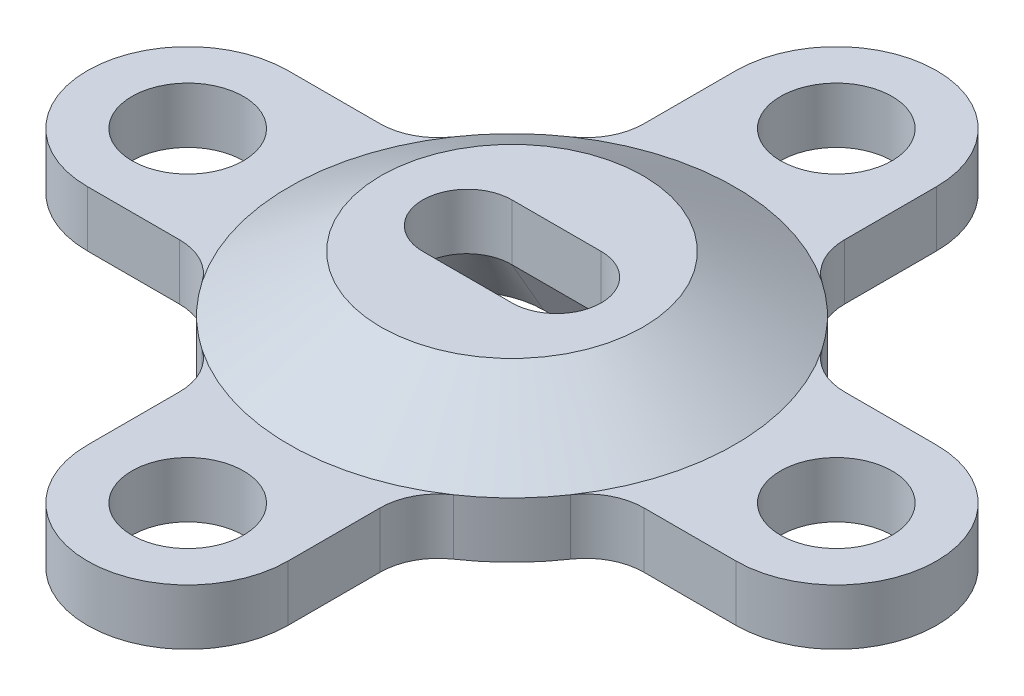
ISO-10303-21;
HEADER;
FILE_DESCRIPTION(('STEP AP214'),'2;1');
FILE_NAME('part.step','',(''),(''),'','','');
FILE_SCHEMA(('AUTOMOTIVE_DESIGN { 1 0 10303 214 1 1 1 1 }'));
ENDSEC;
DATA;
#1=APPLICATION_CONTEXT('core data for automotive mechanical design processes');
#2=APPLICATION_PROTOCOL_DEFINITION('international standard','automotive_design',2000,#1);
#3=PRODUCT_CONTEXT('',#1,'mechanical');
#4=PRODUCT('Part','Part','',(#3));
#5=PRODUCT_RELATED_PRODUCT_CATEGORY('part','',(#4));
#6=PRODUCT_DEFINITION_FORMATION('','',#4);
#7=PRODUCT_DEFINITION_CONTEXT('part definition',#1,'design');
#8=PRODUCT_DEFINITION('design','',#6,#7);
#9=PRODUCT_DEFINITION_SHAPE('','',#8);
#10=(LENGTH_UNIT() NAMED_UNIT(*) SI_UNIT(.MILLI.,.METRE.));
#11=(NAMED_UNIT(*) PLANE_ANGLE_UNIT() SI_UNIT($,.RADIAN.));
#12=(NAMED_UNIT(*) SI_UNIT($,.STERADIAN.) SOLID_ANGLE_UNIT());
#13=UNCERTAINTY_MEASURE_WITH_UNIT(LENGTH_MEASURE(1.E-05),#10,'distance_accuracy_value','');
#14=(GEOMETRIC_REPRESENTATION_CONTEXT(3) GLOBAL_UNCERTAINTY_ASSIGNED_CONTEXT((#13)) GLOBAL_UNIT_ASSIGNED_CONTEXT((#10,
#11,#12)) REPRESENTATION_CONTEXT('',''));
#15=CARTESIAN_POINT('',(0.,0.,0.));
#16=DIRECTION('',(0.,0.,1.));
#17=DIRECTION('',(1.,0.,0.));
#18=AXIS2_PLACEMENT_3D('',#15,#16,#17);
#19=CARTESIAN_POINT('',(0.,0.,0.));
#20=DIRECTION('',(0.,1.,0.));
#21=DIRECTION('',(0.,0.,1.));
#22=AXIS2_PLACEMENT_3D('',#19,#20,#21);
#23=CYLINDRICAL_SURFACE('',#22,12.7);
#24=CARTESIAN_POINT('',(0.,3.175,0.));
#25=DIRECTION('',(0.,1.,0.));
#26=DIRECTION('',(0.,0.,1.));
#27=AXIS2_PLACEMENT_3D('',#24,#25,#26);
#28=CIRCLE('',#27,12.7);
#29=CARTESIAN_POINT('',(-10.4917427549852,3.175,7.1563492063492));
#30=VERTEX_POINT('',#29);
#31=CARTESIAN_POINT('',(-7.15634920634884,3.175,10.4917427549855));
#32=VERTEX_POINT('',#31);
#33=EDGE_CURVE('E696',#30,#32,#28,.T.);
#34=ORIENTED_EDGE('',*,*,#33,.F.);
#35=DIRECTION('',(0.,1.,0.));
#36=VECTOR('',#35,1.);
#37=CARTESIAN_POINT('',(-10.4917427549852,0.,7.1563492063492));
#38=LINE('',#37,#36);
#39=CARTESIAN_POINT('',(-10.4917427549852,0.,7.1563492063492));
#40=VERTEX_POINT('',#39);
#41=EDGE_CURVE('E570',#30,#40,#38,.F.);
#42=ORIENTED_EDGE('',*,*,#41,.T.);
#43=CARTESIAN_POINT('',(0.,0.,0.));
#44=DIRECTION('',(0.,1.,0.));
#45=DIRECTION('',(0.,0.,1.));
#46=AXIS2_PLACEMENT_3D('',#43,#44,#45);
#47=CIRCLE('',#46,12.7);
#48=CARTESIAN_POINT('',(-7.15634920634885,0.,10.4917427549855));
#49=VERTEX_POINT('',#48);
#50=EDGE_CURVE('E538',#40,#49,#47,.T.);
#51=ORIENTED_EDGE('',*,*,#50,.T.);
#52=DIRECTION('',(0.,1.,0.));
#53=VECTOR('',#52,1.);
#54=CARTESIAN_POINT('',(-7.15634920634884,0.,10.4917427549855));
#55=LINE('',#54,#53);
#56=EDGE_CURVE('E567',#49,#32,#55,.T.);
#57=ORIENTED_EDGE('',*,*,#56,.T.);
#58=EDGE_LOOP('',(#34,#42,#51,#57));
#59=FACE_BOUND('',#58,.T.);
#60=ADVANCED_FACE('F32',(#59),#23,.T.);
#61=CARTESIAN_POINT('',(-7.1563492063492,3.175,-10.4917427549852));
#62=VERTEX_POINT('',#61);
#63=CARTESIAN_POINT('',(-10.4917427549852,3.175,-7.15634920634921));
#64=VERTEX_POINT('',#63);
#65=EDGE_CURVE('E542',#62,#64,#28,.T.);
#66=ORIENTED_EDGE('',*,*,#65,.F.);
#67=DIRECTION('',(0.,1.,0.));
#68=VECTOR('',#67,1.);
#69=CARTESIAN_POINT('',(-7.15634920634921,0.,-10.4917427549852));
#70=LINE('',#69,#68);
#71=CARTESIAN_POINT('',(-7.15634920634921,0.,-10.4917427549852));
#72=VERTEX_POINT('',#71);
#73=EDGE_CURVE('E560',#62,#72,#70,.F.);
#74=ORIENTED_EDGE('',*,*,#73,.T.);
#75=CARTESIAN_POINT('',(-10.4917427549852,0.,-7.15634920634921));
#76=VERTEX_POINT('',#75);
#77=EDGE_CURVE('E664',#72,#76,#47,.T.);
#78=ORIENTED_EDGE('',*,*,#77,.T.);
#79=DIRECTION('',(0.,1.,0.));
#80=VECTOR('',#79,1.);
#81=CARTESIAN_POINT('',(-10.4917427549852,0.,-7.15634920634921));
#82=LINE('',#81,#80);
#83=EDGE_CURVE('E557',#76,#64,#82,.T.);
#84=ORIENTED_EDGE('',*,*,#83,.T.);
#85=EDGE_LOOP('',(#66,#74,#78,#84));
#86=FACE_BOUND('',#85,.T.);
#87=ADVANCED_FACE('F640',(#86),#23,.T.);
#88=CARTESIAN_POINT('',(7.15634920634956,3.175,10.491742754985));
#89=VERTEX_POINT('',#88);
#90=CARTESIAN_POINT('',(10.4917427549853,3.175,7.15634920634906));
#91=VERTEX_POINT('',#90);
#92=EDGE_CURVE('E543',#89,#91,#28,.T.);
#93=ORIENTED_EDGE('',*,*,#92,.F.);
#94=DIRECTION('',(0.,1.,0.));
#95=VECTOR('',#94,1.);
#96=CARTESIAN_POINT('',(7.15634920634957,0.,10.491742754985));
#97=LINE('',#96,#95);
#98=CARTESIAN_POINT('',(7.15634920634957,0.,10.491742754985));
#99=VERTEX_POINT('',#98);
#100=EDGE_CURVE('E580',#89,#99,#97,.F.);
#101=ORIENTED_EDGE('',*,*,#100,.T.);
#102=CARTESIAN_POINT('',(10.4917427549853,0.,7.15634920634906));
#103=VERTEX_POINT('',#102);
#104=EDGE_CURVE('E535',#99,#103,#47,.T.);
#105=ORIENTED_EDGE('',*,*,#104,.T.);
#106=DIRECTION('',(0.,1.,0.));
#107=VECTOR('',#106,1.);
#108=CARTESIAN_POINT('',(10.4917427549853,0.,7.15634920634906));
#109=LINE('',#108,#107);
#110=EDGE_CURVE('E577',#103,#91,#109,.T.);
#111=ORIENTED_EDGE('',*,*,#110,.T.);
#112=EDGE_LOOP('',(#93,#101,#105,#111));
#113=FACE_BOUND('',#112,.T.);
#114=ADVANCED_FACE('F645',(#113),#23,.T.);
#115=CARTESIAN_POINT('',(10.4917427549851,3.175,-7.15634920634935));
#116=VERTEX_POINT('',#115);
#117=CARTESIAN_POINT('',(7.1563492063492,3.175,-10.4917427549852));
#118=VERTEX_POINT('',#117);
#119=EDGE_CURVE('E658',#116,#118,#28,.T.);
#120=ORIENTED_EDGE('',*,*,#119,.F.);
#121=DIRECTION('',(0.,1.,0.));
#122=VECTOR('',#121,1.);
#123=CARTESIAN_POINT('',(10.4917427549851,0.,-7.15634920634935));
#124=LINE('',#123,#122);
#125=CARTESIAN_POINT('',(10.4917427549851,0.,-7.15634920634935));
#126=VERTEX_POINT('',#125);
#127=EDGE_CURVE('E550',#116,#126,#124,.F.);
#128=ORIENTED_EDGE('',*,*,#127,.T.);
#129=CARTESIAN_POINT('',(7.15634920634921,0.,-10.4917427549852));
#130=VERTEX_POINT('',#129);
#131=EDGE_CURVE('E529',#126,#130,#47,.T.);
#132=ORIENTED_EDGE('',*,*,#131,.T.);
#133=DIRECTION('',(0.,1.,0.));
#134=VECTOR('',#133,1.);
#135=CARTESIAN_POINT('',(7.15634920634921,0.,-10.4917427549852));
#136=LINE('',#135,#134);
#137=EDGE_CURVE('E547',#130,#118,#136,.T.);
#138=ORIENTED_EDGE('',*,*,#137,.T.);
#139=EDGE_LOOP('',(#120,#128,#132,#138));
#140=FACE_BOUND('',#139,.T.);
#141=ADVANCED_FACE('F379',(#140),#23,.T.);
#142=CARTESIAN_POINT('',(-12.7,0.,0.));
#143=DIRECTION('',(0.,-1.,0.));
#144=DIRECTION('',(0.,0.,-1.));
#145=AXIS2_PLACEMENT_3D('',#142,#143,#144);
#146=PLANE('',#145);
#147=CARTESIAN_POINT('',(-2.55558589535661,0.,0.));
#148=DIRECTION('',(0.,-1.,0.));
#149=DIRECTION('',(0.,0.,-1.));
#150=AXIS2_PLACEMENT_3D('',#147,#148,#149);
#151=CIRCLE('',#150,4.36080640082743);
#152=CARTESIAN_POINT('',(-2.55558589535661,0.,4.36080640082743));
#153=VERTEX_POINT('',#152);
#154=CARTESIAN_POINT('',(-2.55558589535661,0.,-4.36080640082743));
#155=VERTEX_POINT('',#154);
#156=EDGE_CURVE('E48',#153,#155,#151,.T.);
#157=ORIENTED_EDGE('',*,*,#156,.F.);
#158=DIRECTION('',(-1.,0.,0.));
#159=VECTOR('',#158,1.);
#160=CARTESIAN_POINT('',(-2.55558589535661,0.,4.36080640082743));
#161=LINE('',#160,#159);
#162=CARTESIAN_POINT('',(2.55558589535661,0.,4.36080640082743));
#163=VERTEX_POINT('',#162);
#164=EDGE_CURVE('E278',#163,#153,#161,.T.);
#165=ORIENTED_EDGE('',*,*,#164,.F.);
#166=CARTESIAN_POINT('',(2.55558589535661,0.,0.));
#167=DIRECTION('',(0.,-1.,0.));
#168=DIRECTION('',(0.,0.,-1.));
#169=AXIS2_PLACEMENT_3D('',#166,#167,#168);
#170=CIRCLE('',#169,4.36080640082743);
#171=CARTESIAN_POINT('',(2.55558589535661,0.,-4.36080640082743));
#172=VERTEX_POINT('',#171);
#173=EDGE_CURVE('E261',#172,#163,#170,.T.);
#174=ORIENTED_EDGE('',*,*,#173,.F.);
#175=DIRECTION('',(1.,0.,0.));
#176=VECTOR('',#175,1.);
#177=CARTESIAN_POINT('',(-2.55558589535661,0.,-4.36080640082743));
#178=LINE('',#177,#176);
#179=EDGE_CURVE('E271',#155,#172,#178,.T.);
#180=ORIENTED_EDGE('',*,*,#179,.F.);
#181=EDGE_LOOP('',(#157,#165,#174,#180));
#182=FACE_BOUND('',#181,.T.);
#183=ORIENTED_EDGE('',*,*,#50,.F.);
#184=CARTESIAN_POINT('',(-13.2195958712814,0.,9.01699999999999));
#185=DIRECTION('',(0.,-1.,0.));
#186=DIRECTION('',(0.,0.,-1.));
#187=AXIS2_PLACEMENT_3D('',#184,#185,#186);
#188=CIRCLE('',#187,3.302);
#189=CARTESIAN_POINT('',(-13.2195958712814,0.,5.71499999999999));
#190=VERTEX_POINT('',#189);
#191=EDGE_CURVE('E605',#40,#190,#188,.F.);
#192=ORIENTED_EDGE('',*,*,#191,.T.);
#193=DIRECTION('',(1.,0.,0.));
#194=VECTOR('',#193,1.);
#195=CARTESIAN_POINT('',(-18.4630105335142,0.,5.71500000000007));
#196=LINE('',#195,#194);
#197=CARTESIAN_POINT('',(-18.4630105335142,0.,5.71500000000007));
#198=VERTEX_POINT('',#197);
#199=EDGE_CURVE('E421',#198,#190,#196,.T.);
#200=ORIENTED_EDGE('',*,*,#199,.F.);
#201=CARTESIAN_POINT('',(-18.4630105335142,0.,0.));
#202=DIRECTION('',(0.,1.,0.));
#203=DIRECTION('',(0.,0.,1.));
#204=AXIS2_PLACEMENT_3D('',#201,#202,#203);
#205=CIRCLE('',#204,5.715);
#206=CARTESIAN_POINT('',(-18.4630105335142,0.,-5.71499999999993));
#207=VERTEX_POINT('',#206);
#208=EDGE_CURVE('E406',#207,#198,#205,.T.);
#209=ORIENTED_EDGE('',*,*,#208,.F.);
#210=DIRECTION('',(-1.,0.,0.));
#211=VECTOR('',#210,1.);
#212=CARTESIAN_POINT('',(-18.4630105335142,0.,-5.71499999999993));
#213=LINE('',#212,#211);
#214=CARTESIAN_POINT('',(-13.2195958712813,0.,-5.71500000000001));
#215=VERTEX_POINT('',#214);
#216=EDGE_CURVE('E413',#215,#207,#213,.T.);
#217=ORIENTED_EDGE('',*,*,#216,.F.);
#218=CARTESIAN_POINT('',(-13.2195958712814,0.,-9.01700000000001));
#219=DIRECTION('',(0.,-1.,0.));
#220=DIRECTION('',(0.,0.,-1.));
#221=AXIS2_PLACEMENT_3D('',#218,#219,#220);
#222=CIRCLE('',#221,3.302);
#223=EDGE_CURVE('E603',#215,#76,#222,.F.);
#224=ORIENTED_EDGE('',*,*,#223,.T.);
#225=ORIENTED_EDGE('',*,*,#77,.F.);
#226=CARTESIAN_POINT('',(-9.017,0.,-13.2195958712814));
#227=DIRECTION('',(0.,-1.,0.));
#228=DIRECTION('',(0.,0.,-1.));
#229=AXIS2_PLACEMENT_3D('',#226,#227,#228);
#230=CIRCLE('',#229,3.302);
#231=CARTESIAN_POINT('',(-5.715,0.,-13.2195958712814));
#232=VERTEX_POINT('',#231);
#233=EDGE_CURVE('E596',#72,#232,#230,.F.);
#234=ORIENTED_EDGE('',*,*,#233,.T.);
#235=DIRECTION('',(0.,0.,1.));
#236=VECTOR('',#235,1.);
#237=CARTESIAN_POINT('',(-5.715,0.,-18.4630105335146));
#238=LINE('',#237,#236);
#239=CARTESIAN_POINT('',(-5.715,0.,-18.4630105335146));
#240=VERTEX_POINT('',#239);
#241=EDGE_CURVE('E505',#240,#232,#238,.T.);
#242=ORIENTED_EDGE('',*,*,#241,.F.);
#243=CARTESIAN_POINT('',(0.,0.,-18.4630105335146));
#244=DIRECTION('',(0.,1.,0.));
#245=DIRECTION('',(0.,0.,1.));
#246=AXIS2_PLACEMENT_3D('',#243,#244,#245);
#247=CIRCLE('',#246,5.715);
#248=CARTESIAN_POINT('',(5.715,0.,-18.4630105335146));
#249=VERTEX_POINT('',#248);
#250=EDGE_CURVE('E490',#249,#240,#247,.T.);
#251=ORIENTED_EDGE('',*,*,#250,.F.);
#252=DIRECTION('',(0.,0.,-1.));
#253=VECTOR('',#252,1.);
#254=CARTESIAN_POINT('',(5.715,0.,-18.4630105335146));
#255=LINE('',#254,#253);
#256=CARTESIAN_POINT('',(5.715,0.,-13.2195958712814));
#257=VERTEX_POINT('',#256);
#258=EDGE_CURVE('E497',#257,#249,#255,.T.);
#259=ORIENTED_EDGE('',*,*,#258,.F.);
#260=CARTESIAN_POINT('',(9.017,0.,-13.2195958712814));
#261=DIRECTION('',(0.,-1.,0.));
#262=DIRECTION('',(0.,0.,-1.));
#263=AXIS2_PLACEMENT_3D('',#260,#261,#262);
#264=CIRCLE('',#263,3.302);
#265=EDGE_CURVE('E594',#257,#130,#264,.F.);
#266=ORIENTED_EDGE('',*,*,#265,.T.);
#267=ORIENTED_EDGE('',*,*,#131,.F.);
#268=CARTESIAN_POINT('',(13.2195958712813,0.,-9.01700000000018));
#269=DIRECTION('',(0.,-1.,0.));
#270=DIRECTION('',(0.,0.,-1.));
#271=AXIS2_PLACEMENT_3D('',#268,#269,#270);
#272=CIRCLE('',#271,3.302);
#273=CARTESIAN_POINT('',(13.2195958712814,0.,-5.71500000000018));
#274=VERTEX_POINT('',#273);
#275=EDGE_CURVE('E587',#126,#274,#272,.F.);
#276=ORIENTED_EDGE('',*,*,#275,.T.);
#277=DIRECTION('',(-1.,0.,0.));
#278=VECTOR('',#277,1.);
#279=CARTESIAN_POINT('',(18.4630105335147,0.,-5.71500000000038));
#280=LINE('',#279,#278);
#281=CARTESIAN_POINT('',(18.4630105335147,0.,-5.71500000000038));
#282=VERTEX_POINT('',#281);
#283=EDGE_CURVE('E477',#282,#274,#280,.T.);
#284=ORIENTED_EDGE('',*,*,#283,.F.);
#285=CARTESIAN_POINT('',(18.4630105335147,0.,-3.85371783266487E-13));
#286=DIRECTION('',(0.,1.,0.));
#287=DIRECTION('',(0.,0.,1.));
#288=AXIS2_PLACEMENT_3D('',#285,#286,#287);
#289=CIRCLE('',#288,5.715);
#290=CARTESIAN_POINT('',(18.4630105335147,0.,5.71499999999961));
#291=VERTEX_POINT('',#290);
#292=EDGE_CURVE('E462',#291,#282,#289,.T.);
#293=ORIENTED_EDGE('',*,*,#292,.F.);
#294=DIRECTION('',(1.,0.,0.));
#295=VECTOR('',#294,1.);
#296=CARTESIAN_POINT('',(18.4630105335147,0.,5.71499999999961));
#297=LINE('',#296,#295);
#298=CARTESIAN_POINT('',(13.2195958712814,0.,5.71499999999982));
#299=VERTEX_POINT('',#298);
#300=EDGE_CURVE('E469',#299,#291,#297,.T.);
#301=ORIENTED_EDGE('',*,*,#300,.F.);
#302=CARTESIAN_POINT('',(13.2195958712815,0.,9.01699999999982));
#303=DIRECTION('',(0.,-1.,0.));
#304=DIRECTION('',(0.,0.,-1.));
#305=AXIS2_PLACEMENT_3D('',#302,#303,#304);
#306=CIRCLE('',#305,3.302);
#307=EDGE_CURVE('E621',#299,#103,#306,.F.);
#308=ORIENTED_EDGE('',*,*,#307,.T.);
#309=ORIENTED_EDGE('',*,*,#104,.F.);
#310=CARTESIAN_POINT('',(9.01700000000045,0.,13.2195958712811));
#311=DIRECTION('',(0.,-1.,0.));
#312=DIRECTION('',(0.,0.,-1.));
#313=AXIS2_PLACEMENT_3D('',#310,#311,#312);
#314=CIRCLE('',#313,3.302);
#315=CARTESIAN_POINT('',(5.71500000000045,0.,13.2195958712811));
#316=VERTEX_POINT('',#315);
#317=EDGE_CURVE('E614',#99,#316,#314,.F.);
#318=ORIENTED_EDGE('',*,*,#317,.T.);
#319=DIRECTION('',(0.,0.,-1.));
#320=VECTOR('',#319,1.);
#321=CARTESIAN_POINT('',(5.71500000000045,0.,18.4630105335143));
#322=LINE('',#321,#320);
#323=CARTESIAN_POINT('',(5.71500000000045,0.,18.4630105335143));
#324=VERTEX_POINT('',#323);
#325=EDGE_CURVE('E449',#324,#316,#322,.T.);
#326=ORIENTED_EDGE('',*,*,#325,.F.);
#327=CARTESIAN_POINT('',(4.51554446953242E-13,0.,18.4630105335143));
#328=DIRECTION('',(0.,1.,0.));
#329=DIRECTION('',(0.,0.,1.));
#330=AXIS2_PLACEMENT_3D('',#327,#328,#329);
#331=CIRCLE('',#330,5.715);
#332=CARTESIAN_POINT('',(-5.71499999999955,0.,18.4630105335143));
#333=VERTEX_POINT('',#332);
#334=EDGE_CURVE('E434',#333,#324,#331,.T.);
#335=ORIENTED_EDGE('',*,*,#334,.F.);
#336=DIRECTION('',(0.,0.,1.));
#337=VECTOR('',#336,1.);
#338=CARTESIAN_POINT('',(-5.71499999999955,0.,18.4630105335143));
#339=LINE('',#338,#337);
#340=CARTESIAN_POINT('',(-5.71499999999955,0.,13.2195958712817));
#341=VERTEX_POINT('',#340);
#342=EDGE_CURVE('E441',#341,#333,#339,.T.);
#343=ORIENTED_EDGE('',*,*,#342,.F.);
#344=CARTESIAN_POINT('',(-9.01699999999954,0.,13.2195958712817));
#345=DIRECTION('',(0.,-1.,0.));
#346=DIRECTION('',(0.,0.,-1.));
#347=AXIS2_PLACEMENT_3D('',#344,#345,#346);
#348=CIRCLE('',#347,3.302);
#349=EDGE_CURVE('E612',#341,#49,#348,.F.);
#350=ORIENTED_EDGE('',*,*,#349,.T.);
#351=EDGE_LOOP('',(#183,#192,#200,#209,#217,#224,#225,#234,#242,#251,#259,#266,#267,#276,#284,
#293,#301,#308,#309,#318,#326,#335,#343,#350));
#352=FACE_BOUND('',#351,.T.);
#353=CARTESIAN_POINT('',(4.51554446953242E-13,0.,18.4630105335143));
#354=DIRECTION('',(0.,1.,0.));
#355=DIRECTION('',(0.,0.,1.));
#356=AXIS2_PLACEMENT_3D('',#353,#354,#355);
#357=CIRCLE('',#356,3.175);
#358=CARTESIAN_POINT('',(4.51554446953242E-13,0.,21.6380105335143));
#359=VERTEX_POINT('',#358);
#360=EDGE_CURVE('E430',#359,#359,#357,.T.);
#361=ORIENTED_EDGE('',*,*,#360,.T.);
#362=EDGE_LOOP('',(#361));
#363=FACE_BOUND('',#362,.T.);
#364=CARTESIAN_POINT('',(0.,0.,-18.4630105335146));
#365=DIRECTION('',(0.,1.,0.));
#366=DIRECTION('',(0.,0.,1.));
#367=AXIS2_PLACEMENT_3D('',#364,#365,#366);
#368=CIRCLE('',#367,3.175);
#369=CARTESIAN_POINT('',(0.,0.,-15.2880105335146));
#370=VERTEX_POINT('',#369);
#371=EDGE_CURVE('E486',#370,#370,#368,.T.);
#372=ORIENTED_EDGE('',*,*,#371,.T.);
#373=EDGE_LOOP('',(#372));
#374=FACE_BOUND('',#373,.T.);
#375=CARTESIAN_POINT('',(18.4630105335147,0.,-3.85371783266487E-13));
#376=DIRECTION('',(0.,1.,0.));
#377=DIRECTION('',(0.,0.,1.));
#378=AXIS2_PLACEMENT_3D('',#375,#376,#377);
#379=CIRCLE('',#378,3.175);
#380=CARTESIAN_POINT('',(18.4630105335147,0.,3.17499999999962));
#381=VERTEX_POINT('',#380);
#382=EDGE_CURVE('E458',#381,#381,#379,.T.);
#383=ORIENTED_EDGE('',*,*,#382,.T.);
#384=EDGE_LOOP('',(#383));
#385=FACE_BOUND('',#384,.T.);
#386=CARTESIAN_POINT('',(-18.4630105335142,0.,0.));
#387=DIRECTION('',(0.,1.,0.));
#388=DIRECTION('',(0.,0.,1.));
#389=AXIS2_PLACEMENT_3D('',#386,#387,#388);
#390=CIRCLE('',#389,3.175);
#391=CARTESIAN_POINT('',(-18.4630105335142,0.,3.17500000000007));
#392=VERTEX_POINT('',#391);
#393=EDGE_CURVE('E298',#392,#392,#390,.T.);
#394=ORIENTED_EDGE('',*,*,#393,.T.);
#395=EDGE_LOOP('',(#394));
#396=FACE_BOUND('',#395,.T.);
#397=ADVANCED_FACE('F275',(#182,#352,#363,#374,#385,#396),#146,.T.);
#398=CARTESIAN_POINT('',(-7.46567662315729,6.35,0.));
#399=DIRECTION('',(0.,1.,0.));
#400=DIRECTION('',(0.,0.,1.));
#401=AXIS2_PLACEMENT_3D('',#398,#399,#400);
#402=PLANE('',#401);
#403=CARTESIAN_POINT('',(-2.54,6.35,0.));
#404=DIRECTION('',(0.,1.,0.));
#405=DIRECTION('',(0.,0.,1.));
#406=AXIS2_PLACEMENT_3D('',#403,#404,#405);
#407=CIRCLE('',#406,2.54);
#408=CARTESIAN_POINT('',(-2.54,6.35,-2.54));
#409=VERTEX_POINT('',#408);
#410=CARTESIAN_POINT('',(-2.54,6.35,2.54));
#411=VERTEX_POINT('',#410);
#412=EDGE_CURVE('E514',#409,#411,#407,.T.);
#413=ORIENTED_EDGE('',*,*,#412,.F.);
#414=DIRECTION('',(-1.,0.,0.));
#415=VECTOR('',#414,1.);
#416=CARTESIAN_POINT('',(-2.54,6.35,-2.54));
#417=LINE('',#416,#415);
#418=CARTESIAN_POINT('',(2.54,6.35,-2.54));
#419=VERTEX_POINT('',#418);
#420=EDGE_CURVE('E523',#419,#409,#417,.T.);
#421=ORIENTED_EDGE('',*,*,#420,.F.);
#422=CARTESIAN_POINT('',(2.54,6.35,0.));
#423=DIRECTION('',(0.,1.,0.));
#424=DIRECTION('',(0.,0.,1.));
#425=AXIS2_PLACEMENT_3D('',#422,#423,#424);
#426=CIRCLE('',#425,2.54);
#427=CARTESIAN_POINT('',(2.54,6.35,2.54));
#428=VERTEX_POINT('',#427);
#429=EDGE_CURVE('E520',#428,#419,#426,.T.);
#430=ORIENTED_EDGE('',*,*,#429,.F.);
#431=DIRECTION('',(1.,0.,0.));
#432=VECTOR('',#431,1.);
#433=CARTESIAN_POINT('',(-2.54,6.35,2.54));
#434=LINE('',#433,#432);
#435=EDGE_CURVE('E517',#411,#428,#434,.T.);
#436=ORIENTED_EDGE('',*,*,#435,.F.);
#437=EDGE_LOOP('',(#413,#421,#430,#436));
#438=FACE_BOUND('',#437,.T.);
#439=CARTESIAN_POINT('',(0.,6.35,0.));
#440=DIRECTION('',(0.,1.,0.));
#441=DIRECTION('',(0.,0.,1.));
#442=AXIS2_PLACEMENT_3D('',#439,#440,#441);
#443=CIRCLE('',#442,7.46567662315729);
#444=CARTESIAN_POINT('',(0.,6.35,7.46567662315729));
#445=VERTEX_POINT('',#444);
#446=EDGE_CURVE('E541',#445,#445,#443,.T.);
#447=ORIENTED_EDGE('',*,*,#446,.T.);
#448=EDGE_LOOP('',(#447));
#449=FACE_BOUND('',#448,.T.);
#450=ADVANCED_FACE('F632',(#438,#449),#402,.T.);
#451=CARTESIAN_POINT('',(0.,6.35,0.));
#452=DIRECTION('',(0.,-1.,0.));
#453=DIRECTION('',(0.,0.,-1.));
#454=AXIS2_PLACEMENT_3D('',#451,#452,#453);
#455=CONICAL_SURFACE('',#454,7.46567662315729,1.02555764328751);
#456=EDGE_CURVE('E539',#118,#62,#28,.T.);
#457=ORIENTED_EDGE('',*,*,#456,.T.);
#458=ORIENTED_EDGE('',*,*,#65,.T.);
#459=EDGE_CURVE('E665',#64,#30,#28,.T.);
#460=ORIENTED_EDGE('',*,*,#459,.T.);
#461=ORIENTED_EDGE('',*,*,#33,.T.);
#462=EDGE_CURVE('E695',#32,#89,#28,.T.);
#463=ORIENTED_EDGE('',*,*,#462,.T.);
#464=ORIENTED_EDGE('',*,*,#92,.T.);
#465=EDGE_CURVE('E544',#91,#116,#28,.T.);
#466=ORIENTED_EDGE('',*,*,#465,.T.);
#467=ORIENTED_EDGE('',*,*,#119,.T.);
#468=EDGE_LOOP('',(#457,#458,#460,#461,#463,#464,#466,#467));
#469=FACE_BOUND('',#468,.T.);
#470=ORIENTED_EDGE('',*,*,#446,.F.);
#471=EDGE_LOOP('',(#470));
#472=FACE_BOUND('',#471,.T.);
#473=ADVANCED_FACE('F378',(#469,#472),#455,.T.);
#474=CARTESIAN_POINT('',(-2.54,-9.398,0.));
#475=DIRECTION('',(0.,1.,0.));
#476=DIRECTION('',(0.,0.,1.));
#477=AXIS2_PLACEMENT_3D('',#474,#475,#476);
#478=CYLINDRICAL_SURFACE('',#477,2.54);
#479=DIRECTION('',(0.,1.,0.));
#480=VECTOR('',#479,1.);
#481=CARTESIAN_POINT('',(-2.54,-9.398,2.54));
#482=LINE('',#481,#480);
#483=CARTESIAN_POINT('',(-2.54,3.15372919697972,2.54));
#484=VERTEX_POINT('',#483);
#485=EDGE_CURVE('E526',#484,#411,#482,.T.);
#486=ORIENTED_EDGE('',*,*,#485,.F.);
#487=CARTESIAN_POINT('',(-2.54,7.55313824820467,0.));
#488=DIRECTION('',(0.,0.5,0.866025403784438));
#489=DIRECTION('',(0.,0.866025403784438,-0.5));
#490=AXIS2_PLACEMENT_3D('',#487,#488,#489);
#491=ELLIPSE('',#490,5.08,2.54);
#492=CARTESIAN_POINT('',(-2.55558589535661,3.15381202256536,2.53995218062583));
#493=VERTEX_POINT('',#492);
#494=EDGE_CURVE('E56',#484,#493,#491,.F.);
#495=ORIENTED_EDGE('',*,*,#494,.T.);
#496=CARTESIAN_POINT('',(-2.5553858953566,3.153809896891,2.53995340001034));
#497=CARTESIAN_POINT('',(-2.62734271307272,3.1545746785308,2.53952463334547));
#498=CARTESIAN_POINT('',(-2.69927771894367,3.15533943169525,2.53602391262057));
#499=CARTESIAN_POINT('',(-2.84259007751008,3.15686340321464,2.52293627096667));
#500=CARTESIAN_POINT('',(-2.91396744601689,3.15762262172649,2.51334952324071));
#501=CARTESIAN_POINT('',(-3.05560050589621,3.15912951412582,2.48815713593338));
#502=CARTESIAN_POINT('',(-3.12585701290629,3.15987719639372,2.47255610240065));
#503=CARTESIAN_POINT('',(-3.26477514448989,3.16135595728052,2.43546216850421));
#504=CARTESIAN_POINT('',(-3.33343682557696,3.16208703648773,2.41396947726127));
#505=CARTESIAN_POINT('',(-3.5354324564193,3.16423832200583,2.34116817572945));
#506=CARTESIAN_POINT('',(-3.66581028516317,3.16562757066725,2.28135091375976));
#507=CARTESIAN_POINT('',(-3.91452830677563,3.16827895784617,2.14071951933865));
#508=CARTESIAN_POINT('',(-4.03287782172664,3.16954119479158,2.059921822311));
#509=CARTESIAN_POINT('',(-4.22179927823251,3.1715568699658,1.90613055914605));
#510=CARTESIAN_POINT('',(-4.29620656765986,3.17235098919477,1.83779281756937));
#511=CARTESIAN_POINT('',(-4.43635038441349,3.17384704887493,1.6928201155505));
#512=CARTESIAN_POINT('',(-4.50209212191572,3.17454904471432,1.61619019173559));
#513=CARTESIAN_POINT('',(-4.56304124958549,3.1752,1.5358724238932));
#514=B_SPLINE_CURVE_WITH_KNOTS('',3,(#496,#497,#498,#499,#500,#501,#502,#503,#504,#505,#506,
#507,#508,#509,#510,#511,#512,#513),.UNSPECIFIED.,.F.,.F.,(4,2,2,2,2,2,2,2,4),(0.,
0.215815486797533,0.431624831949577,0.64726922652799,0.862905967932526,1.29107015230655,
1.71889993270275,2.02131033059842,2.32353806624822),.UNSPECIFIED.);
#515=CARTESIAN_POINT('',(-4.5443147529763,3.17499999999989,1.56023151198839));
#516=VERTEX_POINT('',#515);
#517=EDGE_CURVE('E11',#493,#516,#514,.T.);
#518=ORIENTED_EDGE('',*,*,#517,.T.);
#519=CARTESIAN_POINT('',(-2.54,3.17499999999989,0.));
#520=DIRECTION('',(0.,-1.,0.));
#521=DIRECTION('',(-0.789100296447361,0.,0.614264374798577));
#522=AXIS2_PLACEMENT_3D('',#519,#520,#521);
#523=CIRCLE('',#522,2.54);
#524=CARTESIAN_POINT('',(-4.54431475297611,3.17499999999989,-1.56023151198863));
#525=VERTEX_POINT('',#524);
#526=EDGE_CURVE('E291',#516,#525,#523,.T.);
#527=ORIENTED_EDGE('',*,*,#526,.T.);
#528=CARTESIAN_POINT('',(-5.07967379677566,3.18072127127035,0.0407063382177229));
#529=CARTESIAN_POINT('',(-5.08082717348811,3.18073360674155,-0.0308200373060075));
#530=CARTESIAN_POINT('',(-5.07894499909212,3.1807134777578,-0.10239193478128));
#531=CARTESIAN_POINT('',(-5.06915473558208,3.18060878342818,-0.245120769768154));
#532=CARTESIAN_POINT('',(-5.0612467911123,3.18052421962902,-0.316277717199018));
#533=CARTESIAN_POINT('',(-5.03946081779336,3.18029126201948,-0.45760542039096));
#534=CARTESIAN_POINT('',(-5.02558859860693,3.18014293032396,-0.527777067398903));
#535=CARTESIAN_POINT('',(-4.99198846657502,3.17978368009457,-0.666682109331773));
#536=CARTESIAN_POINT('',(-4.97226077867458,3.17957276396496,-0.735415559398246));
#537=CARTESIAN_POINT('',(-4.90580986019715,3.17886237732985,-0.934731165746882));
#538=CARTESIAN_POINT('',(-4.85113544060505,3.17827795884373,-1.06276340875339));
#539=CARTESIAN_POINT('',(-4.72167674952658,3.17689454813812,-1.30810955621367));
#540=CARTESIAN_POINT('',(-4.64689553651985,3.17609558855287,-1.42542508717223));
#541=CARTESIAN_POINT('',(-4.47651382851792,3.17427586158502,-1.64984063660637));
#542=CARTESIAN_POINT('',(-4.38032564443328,3.17324883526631,-1.75649578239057));
#543=CARTESIAN_POINT('',(-4.17134246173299,3.17101839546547,-1.95213207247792));
#544=CARTESIAN_POINT('',(-4.0585414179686,3.16981491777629,-2.04110675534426));
#545=CARTESIAN_POINT('',(-3.81982677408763,3.16726924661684,-2.19864978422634));
#546=CARTESIAN_POINT('',(-3.69393964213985,3.16592733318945,-2.26725827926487));
#547=CARTESIAN_POINT('',(-3.43247713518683,3.16314162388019,-2.38232002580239));
#548=CARTESIAN_POINT('',(-3.2969087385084,3.16169790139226,-2.42878905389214));
#549=CARTESIAN_POINT('',(-3.05990668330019,3.15917527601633,-2.48830417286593));
#550=CARTESIAN_POINT('',(-2.95987561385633,3.1581109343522,-2.5071200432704));
#551=CARTESIAN_POINT('',(-2.75834963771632,3.15596746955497,-2.53262881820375));
#552=CARTESIAN_POINT('',(-2.65685662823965,3.1548883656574,-2.53933621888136));
#553=CARTESIAN_POINT('',(-2.51011593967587,3.15332875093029,-2.54022874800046));
#554=CARTESIAN_POINT('',(-2.46485041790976,3.15284773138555,-2.53929190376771));
#555=CARTESIAN_POINT('',(-2.37446318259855,3.15188737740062,-2.53500312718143));
#556=CARTESIAN_POINT('',(-2.32934139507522,3.15140804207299,-2.53165275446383));
#557=CARTESIAN_POINT('',(-2.28432961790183,3.15092995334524,-2.52709965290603));
#558=B_SPLINE_CURVE_WITH_KNOTS('',3,(#528,#529,#530,#531,#532,#533,#534,#535,#536,#537,#538,
#539,#540,#541,#542,#543,#544,#545,#546,#547,#548,#549,#550,#551,#552,#553,#554,#555,#556,#557),
.UNSPECIFIED.,.F.,.F.,(4,2,2,2,2,2,2,2,2,2,2,2,2,2,4),(0.,0.214537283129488,0.429069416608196,
0.643393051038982,0.857708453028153,1.27333651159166,1.68890138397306,2.11771376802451,
2.54668257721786,2.97480003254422,3.40261195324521,3.70732305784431,4.01166912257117,
4.14744948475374,4.283142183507),.UNSPECIFIED.);
#559=CARTESIAN_POINT('',(-2.55558589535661,3.15381202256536,-2.53995218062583));
#560=VERTEX_POINT('',#559);
#561=EDGE_CURVE('E41',#525,#560,#558,.T.);
#562=ORIENTED_EDGE('',*,*,#561,.T.);
#563=CARTESIAN_POINT('',(-2.54,7.55313824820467,0.));
#564=DIRECTION('',(0.,0.5,-0.866025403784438));
#565=DIRECTION('',(0.,0.866025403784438,0.5));
#566=AXIS2_PLACEMENT_3D('',#563,#564,#565);
#567=ELLIPSE('',#566,5.08,2.54);
#568=CARTESIAN_POINT('',(-2.54,3.15372919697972,-2.54));
#569=VERTEX_POINT('',#568);
#570=EDGE_CURVE('E295',#560,#569,#567,.F.);
#571=ORIENTED_EDGE('',*,*,#570,.T.);
#572=DIRECTION('',(0.,1.,0.));
#573=VECTOR('',#572,1.);
#574=CARTESIAN_POINT('',(-2.54,-9.398,-2.54));
#575=LINE('',#574,#573);
#576=EDGE_CURVE('E527',#569,#409,#575,.T.);
#577=ORIENTED_EDGE('',*,*,#576,.T.);
#578=ORIENTED_EDGE('',*,*,#412,.T.);
#579=EDGE_LOOP('',(#486,#495,#518,#527,#562,#571,#577,#578));
#580=FACE_BOUND('',#579,.T.);
#581=ADVANCED_FACE('F369',(#580),#478,.F.);
#582=CARTESIAN_POINT('',(-2.54,-9.398,-2.54));
#583=DIRECTION('',(0.,0.,-1.));
#584=DIRECTION('',(-1.,0.,0.));
#585=AXIS2_PLACEMENT_3D('',#582,#583,#584);
#586=PLANE('',#585);
#587=ORIENTED_EDGE('',*,*,#576,.F.);
#588=DIRECTION('',(1.,0.,0.));
#589=VECTOR('',#588,1.);
#590=CARTESIAN_POINT('',(-2.54,3.15372919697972,-2.54));
#591=LINE('',#590,#589);
#592=CARTESIAN_POINT('',(2.54,3.15372919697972,-2.54));
#593=VERTEX_POINT('',#592);
#594=EDGE_CURVE('E292',#569,#593,#591,.T.);
#595=ORIENTED_EDGE('',*,*,#594,.T.);
#596=DIRECTION('',(0.,1.,0.));
#597=VECTOR('',#596,1.);
#598=CARTESIAN_POINT('',(2.54,-9.398,-2.54));
#599=LINE('',#598,#597);
#600=EDGE_CURVE('E530',#593,#419,#599,.T.);
#601=ORIENTED_EDGE('',*,*,#600,.T.);
#602=ORIENTED_EDGE('',*,*,#420,.T.);
#603=EDGE_LOOP('',(#587,#595,#601,#602));
#604=FACE_BOUND('',#603,.T.);
#605=ADVANCED_FACE('F344',(#604),#586,.F.);
#606=CARTESIAN_POINT('',(2.54,-9.398,0.));
#607=DIRECTION('',(0.,1.,0.));
#608=DIRECTION('',(0.,0.,1.));
#609=AXIS2_PLACEMENT_3D('',#606,#607,#608);
#610=CYLINDRICAL_SURFACE('',#609,2.54);
#611=ORIENTED_EDGE('',*,*,#600,.F.);
#612=CARTESIAN_POINT('',(2.54,7.55313824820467,0.));
#613=DIRECTION('',(0.,0.5,-0.866025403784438));
#614=DIRECTION('',(0.,0.866025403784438,0.5));
#615=AXIS2_PLACEMENT_3D('',#612,#613,#614);
#616=ELLIPSE('',#615,5.08,2.54);
#617=CARTESIAN_POINT('',(2.55558589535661,3.15381202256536,-2.53995218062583));
#618=VERTEX_POINT('',#617);
#619=EDGE_CURVE('E335',#593,#618,#616,.F.);
#620=ORIENTED_EDGE('',*,*,#619,.T.);
#621=CARTESIAN_POINT('',(2.28432961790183,3.15092995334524,-2.52709965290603));
#622=CARTESIAN_POINT('',(2.32932399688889,3.15140785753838,-2.53164919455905));
#623=CARTESIAN_POINT('',(2.374420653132,3.15188692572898,-2.53499913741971));
#624=CARTESIAN_POINT('',(2.4648026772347,3.15284722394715,-2.53929161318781));
#625=CARTESIAN_POINT('',(2.51008823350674,3.15332845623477,-2.54023017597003));
#626=CARTESIAN_POINT('',(2.69900033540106,3.155336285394,-2.53907589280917));
#627=CARTESIAN_POINT('',(2.84273645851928,3.15686476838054,-2.52598202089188));
#628=CARTESIAN_POINT('',(3.12606843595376,3.15987924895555,-2.47566031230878));
#629=CARTESIAN_POINT('',(3.26565690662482,3.16136517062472,-2.4383918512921));
#630=CARTESIAN_POINT('',(3.53553459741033,3.16423940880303,-2.34113752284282));
#631=CARTESIAN_POINT('',(3.66588466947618,3.16562836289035,-2.28132078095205));
#632=CARTESIAN_POINT('',(3.91455764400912,3.16827927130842,-2.14069101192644));
#633=CARTESIAN_POINT('',(4.03289474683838,3.16954137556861,-2.05990318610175));
#634=CARTESIAN_POINT('',(4.22178435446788,3.17155671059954,-1.90614614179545));
#635=CARTESIAN_POINT('',(4.29617475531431,3.17235064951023,-1.83782871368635));
#636=CARTESIAN_POINT('',(4.43631317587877,3.17384665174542,-1.69285562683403));
#637=CARTESIAN_POINT('',(4.50206216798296,3.17454872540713,-1.61620090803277));
#638=CARTESIAN_POINT('',(4.64949872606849,3.17612339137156,-1.42198094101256));
#639=CARTESIAN_POINT('',(4.72636763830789,3.1769446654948,-1.30070438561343));
#640=CARTESIAN_POINT('',(4.85868074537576,3.17835859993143,-1.04683457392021));
#641=CARTESIAN_POINT('',(4.9140967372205,3.17895095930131,-0.914226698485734));
#642=CARTESIAN_POINT('',(5.00039814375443,3.17987357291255,-0.645927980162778));
#643=CARTESIAN_POINT('',(5.03201993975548,3.18021169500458,-0.510476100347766));
#644=CARTESIAN_POINT('',(5.06258170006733,3.18053849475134,-0.30495551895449));
#645=CARTESIAN_POINT('',(5.06995694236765,3.18061736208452,-0.236045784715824));
#646=CARTESIAN_POINT('',(5.07905808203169,3.18071468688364,-0.097850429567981));
#647=CARTESIAN_POINT('',(5.08078367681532,3.18073314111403,-0.0285647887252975));
#648=CARTESIAN_POINT('',(5.07967379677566,3.18072127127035,0.0407063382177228));
#649=B_SPLINE_CURVE_WITH_KNOTS('',3,(#621,#622,#623,#624,#625,#626,#627,#628,#629,#630,#631,
#632,#633,#634,#635,#636,#637,#638,#639,#640,#641,#642,#643,#644,#645,#646,#647,#648),
.UNSPECIFIED.,.F.,.F.,(4,2,2,2,2,2,2,2,2,2,2,2,2,4),(0.,0.135624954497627,0.271473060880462,
0.702174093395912,1.13360078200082,1.56185390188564,1.98959474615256,2.29193083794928,
2.59423287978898,3.02284333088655,3.45201535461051,3.8672870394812,4.07499647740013,
4.28271703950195),.UNSPECIFIED.);
#650=CARTESIAN_POINT('',(4.5443147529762,3.17499999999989,-1.56023151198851));
#651=VERTEX_POINT('',#650);
#652=EDGE_CURVE('E264',#618,#651,#649,.T.);
#653=ORIENTED_EDGE('',*,*,#652,.T.);
#654=CARTESIAN_POINT('',(2.55558589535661,3.175,0.));
#655=DIRECTION('',(0.,1.,0.));
#656=DIRECTION('',(0.786768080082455,0.,0.61724872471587));
#657=AXIS2_PLACEMENT_3D('',#654,#655,#656);
#658=CIRCLE('',#657,2.52771929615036);
#659=CARTESIAN_POINT('',(4.5443147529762,3.17499999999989,1.56023151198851));
#660=VERTEX_POINT('',#659);
#661=EDGE_CURVE('E301',#660,#651,#658,.T.);
#662=ORIENTED_EDGE('',*,*,#661,.F.);
#663=CARTESIAN_POINT('',(4.56304124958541,3.1752,1.5358724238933));
#664=CARTESIAN_POINT('',(4.51975443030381,3.17473768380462,1.59290106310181));
#665=CARTESIAN_POINT('',(4.47404751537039,3.17424959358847,1.64808819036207));
#666=CARTESIAN_POINT('',(4.37814274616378,3.1732256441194,1.75440804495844));
#667=CARTESIAN_POINT('',(4.32794503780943,3.1726897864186,1.80554090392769));
#668=CARTESIAN_POINT('',(4.22344367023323,3.17157446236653,1.90334847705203));
#669=CARTESIAN_POINT('',(4.16914307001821,3.17099502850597,1.95002645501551));
#670=CARTESIAN_POINT('',(4.05681612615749,3.16979665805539,2.03862503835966));
#671=CARTESIAN_POINT('',(3.9987898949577,3.1691777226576,2.08054578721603));
#672=CARTESIAN_POINT('',(3.8198886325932,3.16726990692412,2.19859860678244));
#673=CARTESIAN_POINT('',(3.69395009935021,3.16592744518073,2.26724625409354));
#674=CARTESIAN_POINT('',(3.43245654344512,3.1631414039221,2.3823365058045));
#675=CARTESIAN_POINT('',(3.29690882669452,3.16169790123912,2.4287957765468));
#676=CARTESIAN_POINT('',(3.05993466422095,3.15917557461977,2.48829234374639));
#677=CARTESIAN_POINT('',(2.95992186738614,3.15811142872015,2.50710130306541));
#678=CARTESIAN_POINT('',(2.75842610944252,3.15596828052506,2.5326320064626));
#679=CARTESIAN_POINT('',(2.65694405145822,3.15488928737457,2.53936088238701));
#680=CARTESIAN_POINT('',(2.5553858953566,3.153809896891,2.53995340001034));
#681=B_SPLINE_CURVE_WITH_KNOTS('',3,(#663,#664,#665,#666,#667,#668,#669,#670,#671,#672,#673,
#674,#675,#676,#677,#678,#679,#680),.UNSPECIFIED.,.F.,.F.,(4,2,2,2,2,2,2,2,4),(0.,
0.21472307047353,0.42943916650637,0.643996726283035,0.858547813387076,1.28667354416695,
1.71447718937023,2.01909572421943,2.32353435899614),.UNSPECIFIED.);
#682=CARTESIAN_POINT('',(2.55558589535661,3.15381202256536,2.53995218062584));
#683=VERTEX_POINT('',#682);
#684=EDGE_CURVE('E354',#660,#683,#681,.T.);
#685=ORIENTED_EDGE('',*,*,#684,.T.);
#686=CARTESIAN_POINT('',(2.54,7.55313824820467,0.));
#687=DIRECTION('',(0.,0.5,0.866025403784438));
#688=DIRECTION('',(0.,0.866025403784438,-0.5));
#689=AXIS2_PLACEMENT_3D('',#686,#687,#688);
#690=ELLIPSE('',#689,5.08,2.54);
#691=CARTESIAN_POINT('',(2.54,3.15372919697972,2.54));
#692=VERTEX_POINT('',#691);
#693=EDGE_CURVE('E285',#683,#692,#690,.F.);
#694=ORIENTED_EDGE('',*,*,#693,.T.);
#695=DIRECTION('',(0.,1.,0.));
#696=VECTOR('',#695,1.);
#697=CARTESIAN_POINT('',(2.54,-9.398,2.54));
#698=LINE('',#697,#696);
#699=EDGE_CURVE('E532',#692,#428,#698,.T.);
#700=ORIENTED_EDGE('',*,*,#699,.T.);
#701=ORIENTED_EDGE('',*,*,#429,.T.);
#702=EDGE_LOOP('',(#611,#620,#653,#662,#685,#694,#700,#701));
#703=FACE_BOUND('',#702,.T.);
#704=ADVANCED_FACE('F338',(#703),#610,.F.);
#705=CARTESIAN_POINT('',(-2.54,-9.398,2.54));
#706=DIRECTION('',(0.,0.,1.));
#707=DIRECTION('',(1.,0.,0.));
#708=AXIS2_PLACEMENT_3D('',#705,#706,#707);
#709=PLANE('',#708);
#710=ORIENTED_EDGE('',*,*,#699,.F.);
#711=DIRECTION('',(-1.,0.,0.));
#712=VECTOR('',#711,1.);
#713=CARTESIAN_POINT('',(-2.54,3.15372919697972,2.54));
#714=LINE('',#713,#712);
#715=EDGE_CURVE('E622',#692,#484,#714,.T.);
#716=ORIENTED_EDGE('',*,*,#715,.T.);
#717=ORIENTED_EDGE('',*,*,#485,.T.);
#718=ORIENTED_EDGE('',*,*,#435,.T.);
#719=EDGE_LOOP('',(#710,#716,#717,#718));
#720=FACE_BOUND('',#719,.T.);
#721=ADVANCED_FACE('F343',(#720),#709,.F.);
#722=CARTESIAN_POINT('',(0.,3.175,-18.4630105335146));
#723=DIRECTION('',(0.,1.,0.));
#724=DIRECTION('',(0.,0.,1.));
#725=AXIS2_PLACEMENT_3D('',#722,#723,#724);
#726=PLANE('',#725);
#727=DIRECTION('',(0.,0.,1.));
#728=VECTOR('',#727,1.);
#729=CARTESIAN_POINT('',(-5.715,3.175,-18.4630105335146));
#730=LINE('',#729,#728);
#731=CARTESIAN_POINT('',(-5.715,3.175,-18.4630105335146));
#732=VERTEX_POINT('',#731);
#733=CARTESIAN_POINT('',(-5.715,3.175,-13.2195958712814));
#734=VERTEX_POINT('',#733);
#735=EDGE_CURVE('E496',#732,#734,#730,.T.);
#736=ORIENTED_EDGE('',*,*,#735,.T.);
#737=CARTESIAN_POINT('',(-9.017,3.175,-13.2195958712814));
#738=DIRECTION('',(0.,1.,0.));
#739=DIRECTION('',(0.,0.,1.));
#740=AXIS2_PLACEMENT_3D('',#737,#738,#739);
#741=CIRCLE('',#740,3.302);
#742=EDGE_CURVE('E598',#734,#62,#741,.F.);
#743=ORIENTED_EDGE('',*,*,#742,.T.);
#744=ORIENTED_EDGE('',*,*,#456,.F.);
#745=CARTESIAN_POINT('',(9.017,3.175,-13.2195958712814));
#746=DIRECTION('',(0.,1.,0.));
#747=DIRECTION('',(0.,0.,1.));
#748=AXIS2_PLACEMENT_3D('',#745,#746,#747);
#749=CIRCLE('',#748,3.302);
#750=CARTESIAN_POINT('',(5.715,3.175,-13.2195958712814));
#751=VERTEX_POINT('',#750);
#752=EDGE_CURVE('E592',#118,#751,#749,.F.);
#753=ORIENTED_EDGE('',*,*,#752,.T.);
#754=DIRECTION('',(0.,0.,-1.));
#755=VECTOR('',#754,1.);
#756=CARTESIAN_POINT('',(5.715,3.175,-18.4630105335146));
#757=LINE('',#756,#755);
#758=CARTESIAN_POINT('',(5.715,3.175,-18.4630105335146));
#759=VERTEX_POINT('',#758);
#760=EDGE_CURVE('E500',#751,#759,#757,.T.);
#761=ORIENTED_EDGE('',*,*,#760,.T.);
#762=CARTESIAN_POINT('',(0.,3.175,-18.4630105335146));
#763=DIRECTION('',(0.,1.,0.));
#764=DIRECTION('',(0.,0.,1.));
#765=AXIS2_PLACEMENT_3D('',#762,#763,#764);
#766=CIRCLE('',#765,5.715);
#767=EDGE_CURVE('E493',#759,#732,#766,.T.);
#768=ORIENTED_EDGE('',*,*,#767,.T.);
#769=EDGE_LOOP('',(#736,#743,#744,#753,#761,#768));
#770=FACE_BOUND('',#769,.T.);
#771=CARTESIAN_POINT('',(0.,3.175,-18.4630105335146));
#772=DIRECTION('',(0.,1.,0.));
#773=DIRECTION('',(0.,0.,1.));
#774=AXIS2_PLACEMENT_3D('',#771,#772,#773);
#775=CIRCLE('',#774,3.175);
#776=CARTESIAN_POINT('',(0.,3.175,-15.2880105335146));
#777=VERTEX_POINT('',#776);
#778=EDGE_CURVE('E487',#777,#777,#775,.T.);
#779=ORIENTED_EDGE('',*,*,#778,.F.);
#780=EDGE_LOOP('',(#779));
#781=FACE_BOUND('',#780,.T.);
#782=ADVANCED_FACE('F705',(#770,#781),#726,.T.);
#783=CARTESIAN_POINT('',(0.,3.175,-18.4630105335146));
#784=DIRECTION('',(0.,-1.,0.));
#785=DIRECTION('',(0.,0.,-1.));
#786=AXIS2_PLACEMENT_3D('',#783,#784,#785);
#787=CYLINDRICAL_SURFACE('',#786,5.715);
#788=ORIENTED_EDGE('',*,*,#250,.T.);
#789=DIRECTION('',(0.,-1.,0.));
#790=VECTOR('',#789,1.);
#791=CARTESIAN_POINT('',(-5.715,3.175,-18.4630105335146));
#792=LINE('',#791,#790);
#793=EDGE_CURVE('E511',#732,#240,#792,.T.);
#794=ORIENTED_EDGE('',*,*,#793,.F.);
#795=ORIENTED_EDGE('',*,*,#767,.F.);
#796=DIRECTION('',(0.,-1.,0.));
#797=VECTOR('',#796,1.);
#798=CARTESIAN_POINT('',(5.715,3.175,-18.4630105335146));
#799=LINE('',#798,#797);
#800=EDGE_CURVE('E502',#759,#249,#799,.T.);
#801=ORIENTED_EDGE('',*,*,#800,.T.);
#802=EDGE_LOOP('',(#788,#794,#795,#801));
#803=FACE_BOUND('',#802,.T.);
#804=ADVANCED_FACE('F717',(#803),#787,.T.);
#805=CARTESIAN_POINT('',(-5.715,3.175,-18.4630105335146));
#806=DIRECTION('',(1.,0.,0.));
#807=DIRECTION('',(0.,0.,-1.));
#808=AXIS2_PLACEMENT_3D('',#805,#806,#807);
#809=PLANE('',#808);
#810=ORIENTED_EDGE('',*,*,#241,.T.);
#811=DIRECTION('',(0.,1.,0.));
#812=VECTOR('',#811,1.);
#813=CARTESIAN_POINT('',(-5.715,3.175,-13.2195958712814));
#814=LINE('',#813,#812);
#815=EDGE_CURVE('E563',#232,#734,#814,.T.);
#816=ORIENTED_EDGE('',*,*,#815,.T.);
#817=ORIENTED_EDGE('',*,*,#735,.F.);
#818=ORIENTED_EDGE('',*,*,#793,.T.);
#819=EDGE_LOOP('',(#810,#816,#817,#818));
#820=FACE_BOUND('',#819,.T.);
#821=ADVANCED_FACE('F713',(#820),#809,.F.);
#822=CARTESIAN_POINT('',(5.715,3.175,-18.4630105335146));
#823=DIRECTION('',(-1.,0.,0.));
#824=DIRECTION('',(0.,0.,1.));
#825=AXIS2_PLACEMENT_3D('',#822,#823,#824);
#826=PLANE('',#825);
#827=ORIENTED_EDGE('',*,*,#760,.F.);
#828=DIRECTION('',(0.,1.,0.));
#829=VECTOR('',#828,1.);
#830=CARTESIAN_POINT('',(5.715,3.175,-13.2195958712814));
#831=LINE('',#830,#829);
#832=EDGE_CURVE('E555',#751,#257,#831,.F.);
#833=ORIENTED_EDGE('',*,*,#832,.T.);
#834=ORIENTED_EDGE('',*,*,#258,.T.);
#835=ORIENTED_EDGE('',*,*,#800,.F.);
#836=EDGE_LOOP('',(#827,#833,#834,#835));
#837=FACE_BOUND('',#836,.T.);
#838=ADVANCED_FACE('F726',(#837),#826,.F.);
#839=CARTESIAN_POINT('',(0.,3.175,-18.4630105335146));
#840=DIRECTION('',(0.,-1.,0.));
#841=DIRECTION('',(0.,0.,-1.));
#842=AXIS2_PLACEMENT_3D('',#839,#840,#841);
#843=CYLINDRICAL_SURFACE('',#842,3.175);
#844=ORIENTED_EDGE('',*,*,#778,.T.);
#845=EDGE_LOOP('',(#844));
#846=FACE_BOUND('',#845,.T.);
#847=ORIENTED_EDGE('',*,*,#371,.F.);
#848=EDGE_LOOP('',(#847));
#849=FACE_BOUND('',#848,.T.);
#850=ADVANCED_FACE('F728',(#846,#849),#843,.F.);
#851=CARTESIAN_POINT('',(18.4630105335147,3.175,-3.85371783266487E-13));
#852=DIRECTION('',(0.,1.,0.));
#853=DIRECTION('',(0.,0.,1.));
#854=AXIS2_PLACEMENT_3D('',#851,#852,#853);
#855=PLANE('',#854);
#856=DIRECTION('',(-1.,0.,0.));
#857=VECTOR('',#856,1.);
#858=CARTESIAN_POINT('',(18.4630105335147,3.175,-5.71500000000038));
#859=LINE('',#858,#857);
#860=CARTESIAN_POINT('',(18.4630105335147,3.175,-5.71500000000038));
#861=VERTEX_POINT('',#860);
#862=CARTESIAN_POINT('',(13.2195958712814,3.175,-5.71500000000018));
#863=VERTEX_POINT('',#862);
#864=EDGE_CURVE('E468',#861,#863,#859,.T.);
#865=ORIENTED_EDGE('',*,*,#864,.T.);
#866=CARTESIAN_POINT('',(13.2195958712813,3.175,-9.01700000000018));
#867=DIRECTION('',(0.,1.,0.));
#868=DIRECTION('',(0.,0.,1.));
#869=AXIS2_PLACEMENT_3D('',#866,#867,#868);
#870=CIRCLE('',#869,3.302);
#871=EDGE_CURVE('E589',#863,#116,#870,.F.);
#872=ORIENTED_EDGE('',*,*,#871,.T.);
#873=ORIENTED_EDGE('',*,*,#465,.F.);
#874=CARTESIAN_POINT('',(13.2195958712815,3.175,9.01699999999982));
#875=DIRECTION('',(0.,1.,0.));
#876=DIRECTION('',(0.,0.,1.));
#877=AXIS2_PLACEMENT_3D('',#874,#875,#876);
#878=CIRCLE('',#877,3.302);
#879=CARTESIAN_POINT('',(13.2195958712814,3.175,5.71499999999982));
#880=VERTEX_POINT('',#879);
#881=EDGE_CURVE('E619',#91,#880,#878,.F.);
#882=ORIENTED_EDGE('',*,*,#881,.T.);
#883=DIRECTION('',(1.,0.,0.));
#884=VECTOR('',#883,1.);
#885=CARTESIAN_POINT('',(18.4630105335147,3.175,5.71499999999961));
#886=LINE('',#885,#884);
#887=CARTESIAN_POINT('',(18.4630105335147,3.175,5.71499999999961));
#888=VERTEX_POINT('',#887);
#889=EDGE_CURVE('E472',#880,#888,#886,.T.);
#890=ORIENTED_EDGE('',*,*,#889,.T.);
#891=CARTESIAN_POINT('',(18.4630105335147,3.175,-3.85371783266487E-13));
#892=DIRECTION('',(0.,1.,0.));
#893=DIRECTION('',(0.,0.,1.));
#894=AXIS2_PLACEMENT_3D('',#891,#892,#893);
#895=CIRCLE('',#894,5.715);
#896=EDGE_CURVE('E465',#888,#861,#895,.T.);
#897=ORIENTED_EDGE('',*,*,#896,.T.);
#898=EDGE_LOOP('',(#865,#872,#873,#882,#890,#897));
#899=FACE_BOUND('',#898,.T.);
#900=CARTESIAN_POINT('',(18.4630105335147,3.175,-3.85371783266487E-13));
#901=DIRECTION('',(0.,1.,0.));
#902=DIRECTION('',(0.,0.,1.));
#903=AXIS2_PLACEMENT_3D('',#900,#901,#902);
#904=CIRCLE('',#903,3.175);
#905=CARTESIAN_POINT('',(18.4630105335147,3.175,3.17499999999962));
#906=VERTEX_POINT('',#905);
#907=EDGE_CURVE('E459',#906,#906,#904,.T.);
#908=ORIENTED_EDGE('',*,*,#907,.F.);
#909=EDGE_LOOP('',(#908));
#910=FACE_BOUND('',#909,.T.);
#911=ADVANCED_FACE('F668',(#899,#910),#855,.T.);
#912=CARTESIAN_POINT('',(18.4630105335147,3.175,-3.85371783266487E-13));
#913=DIRECTION('',(0.,-1.,0.));
#914=DIRECTION('',(0.,0.,-1.));
#915=AXIS2_PLACEMENT_3D('',#912,#913,#914);
#916=CYLINDRICAL_SURFACE('',#915,5.715);
#917=ORIENTED_EDGE('',*,*,#292,.T.);
#918=DIRECTION('',(0.,-1.,0.));
#919=VECTOR('',#918,1.);
#920=CARTESIAN_POINT('',(18.4630105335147,3.175,-5.71500000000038));
#921=LINE('',#920,#919);
#922=EDGE_CURVE('E483',#861,#282,#921,.T.);
#923=ORIENTED_EDGE('',*,*,#922,.F.);
#924=ORIENTED_EDGE('',*,*,#896,.F.);
#925=DIRECTION('',(0.,-1.,0.));
#926=VECTOR('',#925,1.);
#927=CARTESIAN_POINT('',(18.4630105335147,3.175,5.71499999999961));
#928=LINE('',#927,#926);
#929=EDGE_CURVE('E474',#888,#291,#928,.T.);
#930=ORIENTED_EDGE('',*,*,#929,.T.);
#931=EDGE_LOOP('',(#917,#923,#924,#930));
#932=FACE_BOUND('',#931,.T.);
#933=ADVANCED_FACE('F682',(#932),#916,.T.);
#934=CARTESIAN_POINT('',(18.4630105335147,3.175,-5.71500000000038));
#935=DIRECTION('',(0.,0.,1.));
#936=DIRECTION('',(1.,0.,0.));
#937=AXIS2_PLACEMENT_3D('',#934,#935,#936);
#938=PLANE('',#937);
#939=ORIENTED_EDGE('',*,*,#283,.T.);
#940=DIRECTION('',(0.,1.,0.));
#941=VECTOR('',#940,1.);
#942=CARTESIAN_POINT('',(13.2195958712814,3.175,-5.71500000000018));
#943=LINE('',#942,#941);
#944=EDGE_CURVE('E553',#274,#863,#943,.T.);
#945=ORIENTED_EDGE('',*,*,#944,.T.);
#946=ORIENTED_EDGE('',*,*,#864,.F.);
#947=ORIENTED_EDGE('',*,*,#922,.T.);
#948=EDGE_LOOP('',(#939,#945,#946,#947));
#949=FACE_BOUND('',#948,.T.);
#950=ADVANCED_FACE('F678',(#949),#938,.F.);
#951=CARTESIAN_POINT('',(18.4630105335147,3.175,5.71499999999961));
#952=DIRECTION('',(0.,0.,-1.));
#953=DIRECTION('',(-1.,0.,0.));
#954=AXIS2_PLACEMENT_3D('',#951,#952,#953);
#955=PLANE('',#954);
#956=ORIENTED_EDGE('',*,*,#889,.F.);
#957=DIRECTION('',(0.,1.,0.));
#958=VECTOR('',#957,1.);
#959=CARTESIAN_POINT('',(13.2195958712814,3.175,5.71499999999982));
#960=LINE('',#959,#958);
#961=EDGE_CURVE('E585',#880,#299,#960,.F.);
#962=ORIENTED_EDGE('',*,*,#961,.T.);
#963=ORIENTED_EDGE('',*,*,#300,.T.);
#964=ORIENTED_EDGE('',*,*,#929,.F.);
#965=EDGE_LOOP('',(#956,#962,#963,#964));
#966=FACE_BOUND('',#965,.T.);
#967=ADVANCED_FACE('F924',(#966),#955,.F.);
#968=CARTESIAN_POINT('',(18.4630105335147,3.175,-3.85371783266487E-13));
#969=DIRECTION('',(0.,-1.,0.));
#970=DIRECTION('',(0.,0.,-1.));
#971=AXIS2_PLACEMENT_3D('',#968,#969,#970);
#972=CYLINDRICAL_SURFACE('',#971,3.175);
#973=ORIENTED_EDGE('',*,*,#907,.T.);
#974=EDGE_LOOP('',(#973));
#975=FACE_BOUND('',#974,.T.);
#976=ORIENTED_EDGE('',*,*,#382,.F.);
#977=EDGE_LOOP('',(#976));
#978=FACE_BOUND('',#977,.T.);
#979=ADVANCED_FACE('F916',(#975,#978),#972,.F.);
#980=CARTESIAN_POINT('',(4.51554446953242E-13,3.175,18.4630105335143));
#981=DIRECTION('',(0.,1.,0.));
#982=DIRECTION('',(0.,0.,1.));
#983=AXIS2_PLACEMENT_3D('',#980,#981,#982);
#984=PLANE('',#983);
#985=DIRECTION('',(0.,0.,-1.));
#986=VECTOR('',#985,1.);
#987=CARTESIAN_POINT('',(5.71500000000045,3.175,18.4630105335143));
#988=LINE('',#987,#986);
#989=CARTESIAN_POINT('',(5.71500000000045,3.175,18.4630105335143));
#990=VERTEX_POINT('',#989);
#991=CARTESIAN_POINT('',(5.71500000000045,3.175,13.2195958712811));
#992=VERTEX_POINT('',#991);
#993=EDGE_CURVE('E440',#990,#992,#988,.T.);
#994=ORIENTED_EDGE('',*,*,#993,.T.);
#995=CARTESIAN_POINT('',(9.01700000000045,3.175,13.2195958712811));
#996=DIRECTION('',(0.,1.,0.));
#997=DIRECTION('',(0.,0.,1.));
#998=AXIS2_PLACEMENT_3D('',#995,#996,#997);
#999=CIRCLE('',#998,3.302);
#1000=EDGE_CURVE('E616',#992,#89,#999,.F.);
#1001=ORIENTED_EDGE('',*,*,#1000,.T.);
#1002=ORIENTED_EDGE('',*,*,#462,.F.);
#1003=CARTESIAN_POINT('',(-9.01699999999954,3.175,13.2195958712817));
#1004=DIRECTION('',(0.,1.,0.));
#1005=DIRECTION('',(0.,0.,1.));
#1006=AXIS2_PLACEMENT_3D('',#1003,#1004,#1005);
#1007=CIRCLE('',#1006,3.302);
#1008=CARTESIAN_POINT('',(-5.71499999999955,3.175,13.2195958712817));
#1009=VERTEX_POINT('',#1008);
#1010=EDGE_CURVE('E610',#32,#1009,#1007,.F.);
#1011=ORIENTED_EDGE('',*,*,#1010,.T.);
#1012=DIRECTION('',(0.,0.,1.));
#1013=VECTOR('',#1012,1.);
#1014=CARTESIAN_POINT('',(-5.71499999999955,3.175,18.4630105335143));
#1015=LINE('',#1014,#1013);
#1016=CARTESIAN_POINT('',(-5.71499999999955,3.175,18.4630105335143));
#1017=VERTEX_POINT('',#1016);
#1018=EDGE_CURVE('E444',#1009,#1017,#1015,.T.);
#1019=ORIENTED_EDGE('',*,*,#1018,.T.);
#1020=CARTESIAN_POINT('',(4.51554446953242E-13,3.175,18.4630105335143));
#1021=DIRECTION('',(0.,1.,0.));
#1022=DIRECTION('',(0.,0.,1.));
#1023=AXIS2_PLACEMENT_3D('',#1020,#1021,#1022);
#1024=CIRCLE('',#1023,5.715);
#1025=EDGE_CURVE('E437',#1017,#990,#1024,.T.);
#1026=ORIENTED_EDGE('',*,*,#1025,.T.);
#1027=EDGE_LOOP('',(#994,#1001,#1002,#1011,#1019,#1026));
#1028=FACE_BOUND('',#1027,.T.);
#1029=CARTESIAN_POINT('',(4.51554446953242E-13,3.175,18.4630105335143));
#1030=DIRECTION('',(0.,1.,0.));
#1031=DIRECTION('',(0.,0.,1.));
#1032=AXIS2_PLACEMENT_3D('',#1029,#1030,#1031);
#1033=CIRCLE('',#1032,3.175);
#1034=CARTESIAN_POINT('',(4.51554446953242E-13,3.175,21.6380105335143));
#1035=VERTEX_POINT('',#1034);
#1036=EDGE_CURVE('E431',#1035,#1035,#1033,.T.);
#1037=ORIENTED_EDGE('',*,*,#1036,.F.);
#1038=EDGE_LOOP('',(#1037));
#1039=FACE_BOUND('',#1038,.T.);
#1040=ADVANCED_FACE('F911',(#1028,#1039),#984,.T.);
#1041=CARTESIAN_POINT('',(4.51554446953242E-13,3.175,18.4630105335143));
#1042=DIRECTION('',(0.,-1.,0.));
#1043=DIRECTION('',(0.,0.,-1.));
#1044=AXIS2_PLACEMENT_3D('',#1041,#1042,#1043);
#1045=CYLINDRICAL_SURFACE('',#1044,5.715);
#1046=ORIENTED_EDGE('',*,*,#334,.T.);
#1047=DIRECTION('',(0.,-1.,0.));
#1048=VECTOR('',#1047,1.);
#1049=CARTESIAN_POINT('',(5.71500000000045,3.175,18.4630105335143));
#1050=LINE('',#1049,#1048);
#1051=EDGE_CURVE('E455',#990,#324,#1050,.T.);
#1052=ORIENTED_EDGE('',*,*,#1051,.F.);
#1053=ORIENTED_EDGE('',*,*,#1025,.F.);
#1054=DIRECTION('',(0.,-1.,0.));
#1055=VECTOR('',#1054,1.);
#1056=CARTESIAN_POINT('',(-5.71499999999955,3.175,18.4630105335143));
#1057=LINE('',#1056,#1055);
#1058=EDGE_CURVE('E446',#1017,#333,#1057,.T.);
#1059=ORIENTED_EDGE('',*,*,#1058,.T.);
#1060=EDGE_LOOP('',(#1046,#1052,#1053,#1059));
#1061=FACE_BOUND('',#1060,.T.);
#1062=ADVANCED_FACE('F903',(#1061),#1045,.T.);
#1063=CARTESIAN_POINT('',(5.71500000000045,3.175,18.4630105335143));
#1064=DIRECTION('',(-1.,0.,0.));
#1065=DIRECTION('',(0.,0.,1.));
#1066=AXIS2_PLACEMENT_3D('',#1063,#1064,#1065);
#1067=PLANE('',#1066);
#1068=ORIENTED_EDGE('',*,*,#325,.T.);
#1069=DIRECTION('',(0.,1.,0.));
#1070=VECTOR('',#1069,1.);
#1071=CARTESIAN_POINT('',(5.71500000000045,3.175,13.2195958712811));
#1072=LINE('',#1071,#1070);
#1073=EDGE_CURVE('E583',#316,#992,#1072,.T.);
#1074=ORIENTED_EDGE('',*,*,#1073,.T.);
#1075=ORIENTED_EDGE('',*,*,#993,.F.);
#1076=ORIENTED_EDGE('',*,*,#1051,.T.);
#1077=EDGE_LOOP('',(#1068,#1074,#1075,#1076));
#1078=FACE_BOUND('',#1077,.T.);
#1079=ADVANCED_FACE('F893',(#1078),#1067,.F.);
#1080=CARTESIAN_POINT('',(-5.71499999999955,3.175,18.4630105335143));
#1081=DIRECTION('',(1.,0.,0.));
#1082=DIRECTION('',(0.,0.,-1.));
#1083=AXIS2_PLACEMENT_3D('',#1080,#1081,#1082);
#1084=PLANE('',#1083);
#1085=ORIENTED_EDGE('',*,*,#1018,.F.);
#1086=DIRECTION('',(0.,1.,0.));
#1087=VECTOR('',#1086,1.);
#1088=CARTESIAN_POINT('',(-5.71499999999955,3.175,13.2195958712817));
#1089=LINE('',#1088,#1087);
#1090=EDGE_CURVE('E575',#1009,#341,#1089,.F.);
#1091=ORIENTED_EDGE('',*,*,#1090,.T.);
#1092=ORIENTED_EDGE('',*,*,#342,.T.);
#1093=ORIENTED_EDGE('',*,*,#1058,.F.);
#1094=EDGE_LOOP('',(#1085,#1091,#1092,#1093));
#1095=FACE_BOUND('',#1094,.T.);
#1096=ADVANCED_FACE('F888',(#1095),#1084,.F.);
#1097=CARTESIAN_POINT('',(4.51554446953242E-13,3.175,18.4630105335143));
#1098=DIRECTION('',(0.,-1.,0.));
#1099=DIRECTION('',(0.,0.,-1.));
#1100=AXIS2_PLACEMENT_3D('',#1097,#1098,#1099);
#1101=CYLINDRICAL_SURFACE('',#1100,3.175);
#1102=ORIENTED_EDGE('',*,*,#1036,.T.);
#1103=EDGE_LOOP('',(#1102));
#1104=FACE_BOUND('',#1103,.T.);
#1105=ORIENTED_EDGE('',*,*,#360,.F.);
#1106=EDGE_LOOP('',(#1105));
#1107=FACE_BOUND('',#1106,.T.);
#1108=ADVANCED_FACE('F880',(#1104,#1107),#1101,.F.);
#1109=CARTESIAN_POINT('',(-18.4630105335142,3.175,0.));
#1110=DIRECTION('',(0.,1.,0.));
#1111=DIRECTION('',(0.,0.,1.));
#1112=AXIS2_PLACEMENT_3D('',#1109,#1110,#1111);
#1113=PLANE('',#1112);
#1114=DIRECTION('',(1.,0.,0.));
#1115=VECTOR('',#1114,1.);
#1116=CARTESIAN_POINT('',(-18.4630105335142,3.175,5.71500000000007));
#1117=LINE('',#1116,#1115);
#1118=CARTESIAN_POINT('',(-18.4630105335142,3.175,5.71500000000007));
#1119=VERTEX_POINT('',#1118);
#1120=CARTESIAN_POINT('',(-13.2195958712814,3.175,5.71499999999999));
#1121=VERTEX_POINT('',#1120);
#1122=EDGE_CURVE('E412',#1119,#1121,#1117,.T.);
#1123=ORIENTED_EDGE('',*,*,#1122,.T.);
#1124=CARTESIAN_POINT('',(-13.2195958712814,3.175,9.01699999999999));
#1125=DIRECTION('',(0.,1.,0.));
#1126=DIRECTION('',(0.,0.,1.));
#1127=AXIS2_PLACEMENT_3D('',#1124,#1125,#1126);
#1128=CIRCLE('',#1127,3.302);
#1129=EDGE_CURVE('E607',#1121,#30,#1128,.F.);
#1130=ORIENTED_EDGE('',*,*,#1129,.T.);
#1131=ORIENTED_EDGE('',*,*,#459,.F.);
#1132=CARTESIAN_POINT('',(-13.2195958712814,3.175,-9.01700000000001));
#1133=DIRECTION('',(0.,1.,0.));
#1134=DIRECTION('',(0.,0.,1.));
#1135=AXIS2_PLACEMENT_3D('',#1132,#1133,#1134);
#1136=CIRCLE('',#1135,3.302);
#1137=CARTESIAN_POINT('',(-13.2195958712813,3.175,-5.71500000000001));
#1138=VERTEX_POINT('',#1137);
#1139=EDGE_CURVE('E601',#64,#1138,#1136,.F.);
#1140=ORIENTED_EDGE('',*,*,#1139,.T.);
#1141=DIRECTION('',(-1.,0.,0.));
#1142=VECTOR('',#1141,1.);
#1143=CARTESIAN_POINT('',(-18.4630105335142,3.175,-5.71499999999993));
#1144=LINE('',#1143,#1142);
#1145=CARTESIAN_POINT('',(-18.4630105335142,3.175,-5.71499999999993));
#1146=VERTEX_POINT('',#1145);
#1147=EDGE_CURVE('E416',#1138,#1146,#1144,.T.);
#1148=ORIENTED_EDGE('',*,*,#1147,.T.);
#1149=CARTESIAN_POINT('',(-18.4630105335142,3.175,0.));
#1150=DIRECTION('',(0.,1.,0.));
#1151=DIRECTION('',(0.,0.,1.));
#1152=AXIS2_PLACEMENT_3D('',#1149,#1150,#1151);
#1153=CIRCLE('',#1152,5.715);
#1154=EDGE_CURVE('E409',#1146,#1119,#1153,.T.);
#1155=ORIENTED_EDGE('',*,*,#1154,.T.);
#1156=EDGE_LOOP('',(#1123,#1130,#1131,#1140,#1148,#1155));
#1157=FACE_BOUND('',#1156,.T.);
#1158=CARTESIAN_POINT('',(-18.4630105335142,3.175,0.));
#1159=DIRECTION('',(0.,1.,0.));
#1160=DIRECTION('',(0.,0.,1.));
#1161=AXIS2_PLACEMENT_3D('',#1158,#1159,#1160);
#1162=CIRCLE('',#1161,3.175);
#1163=CARTESIAN_POINT('',(-18.4630105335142,3.175,3.17500000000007));
#1164=VERTEX_POINT('',#1163);
#1165=EDGE_CURVE('E398',#1164,#1164,#1162,.T.);
#1166=ORIENTED_EDGE('',*,*,#1165,.F.);
#1167=EDGE_LOOP('',(#1166));
#1168=FACE_BOUND('',#1167,.T.);
#1169=ADVANCED_FACE('F875',(#1157,#1168),#1113,.T.);
#1170=CARTESIAN_POINT('',(-18.4630105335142,3.175,0.));
#1171=DIRECTION('',(0.,-1.,0.));
#1172=DIRECTION('',(0.,0.,-1.));
#1173=AXIS2_PLACEMENT_3D('',#1170,#1171,#1172);
#1174=CYLINDRICAL_SURFACE('',#1173,5.715);
#1175=ORIENTED_EDGE('',*,*,#208,.T.);
#1176=DIRECTION('',(0.,-1.,0.));
#1177=VECTOR('',#1176,1.);
#1178=CARTESIAN_POINT('',(-18.4630105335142,3.175,5.71500000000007));
#1179=LINE('',#1178,#1177);
#1180=EDGE_CURVE('E427',#1119,#198,#1179,.T.);
#1181=ORIENTED_EDGE('',*,*,#1180,.F.);
#1182=ORIENTED_EDGE('',*,*,#1154,.F.);
#1183=DIRECTION('',(0.,-1.,0.));
#1184=VECTOR('',#1183,1.);
#1185=CARTESIAN_POINT('',(-18.4630105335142,3.175,-5.71499999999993));
#1186=LINE('',#1185,#1184);
#1187=EDGE_CURVE('E418',#1146,#207,#1186,.T.);
#1188=ORIENTED_EDGE('',*,*,#1187,.T.);
#1189=EDGE_LOOP('',(#1175,#1181,#1182,#1188));
#1190=FACE_BOUND('',#1189,.T.);
#1191=ADVANCED_FACE('F867',(#1190),#1174,.T.);
#1192=CARTESIAN_POINT('',(-18.4630105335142,3.175,5.71500000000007));
#1193=DIRECTION('',(0.,0.,-1.));
#1194=DIRECTION('',(-1.,0.,0.));
#1195=AXIS2_PLACEMENT_3D('',#1192,#1193,#1194);
#1196=PLANE('',#1195);
#1197=ORIENTED_EDGE('',*,*,#199,.T.);
#1198=DIRECTION('',(0.,1.,0.));
#1199=VECTOR('',#1198,1.);
#1200=CARTESIAN_POINT('',(-13.2195958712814,3.175,5.71499999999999));
#1201=LINE('',#1200,#1199);
#1202=EDGE_CURVE('E573',#190,#1121,#1201,.T.);
#1203=ORIENTED_EDGE('',*,*,#1202,.T.);
#1204=ORIENTED_EDGE('',*,*,#1122,.F.);
#1205=ORIENTED_EDGE('',*,*,#1180,.T.);
#1206=EDGE_LOOP('',(#1197,#1203,#1204,#1205));
#1207=FACE_BOUND('',#1206,.T.);
#1208=ADVANCED_FACE('F857',(#1207),#1196,.F.);
#1209=CARTESIAN_POINT('',(-18.4630105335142,3.175,-5.71499999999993));
#1210=DIRECTION('',(0.,0.,1.));
#1211=DIRECTION('',(1.,0.,0.));
#1212=AXIS2_PLACEMENT_3D('',#1209,#1210,#1211);
#1213=PLANE('',#1212);
#1214=ORIENTED_EDGE('',*,*,#1147,.F.);
#1215=DIRECTION('',(0.,1.,0.));
#1216=VECTOR('',#1215,1.);
#1217=CARTESIAN_POINT('',(-13.2195958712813,3.175,-5.71500000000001));
#1218=LINE('',#1217,#1216);
#1219=EDGE_CURVE('E565',#1138,#215,#1218,.F.);
#1220=ORIENTED_EDGE('',*,*,#1219,.T.);
#1221=ORIENTED_EDGE('',*,*,#216,.T.);
#1222=ORIENTED_EDGE('',*,*,#1187,.F.);
#1223=EDGE_LOOP('',(#1214,#1220,#1221,#1222));
#1224=FACE_BOUND('',#1223,.T.);
#1225=ADVANCED_FACE('F852',(#1224),#1213,.F.);
#1226=CARTESIAN_POINT('',(-18.4630105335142,3.175,0.));
#1227=DIRECTION('',(0.,-1.,0.));
#1228=DIRECTION('',(0.,0.,-1.));
#1229=AXIS2_PLACEMENT_3D('',#1226,#1227,#1228);
#1230=CYLINDRICAL_SURFACE('',#1229,3.175);
#1231=ORIENTED_EDGE('',*,*,#1165,.T.);
#1232=EDGE_LOOP('',(#1231));
#1233=FACE_BOUND('',#1232,.T.);
#1234=ORIENTED_EDGE('',*,*,#393,.F.);
#1235=EDGE_LOOP('',(#1234));
#1236=FACE_BOUND('',#1235,.T.);
#1237=ADVANCED_FACE('F845',(#1233,#1236),#1230,.F.);
#1238=CARTESIAN_POINT('',(13.2195958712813,0.,-9.01700000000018));
#1239=DIRECTION('',(0.,1.,0.));
#1240=DIRECTION('',(0.,0.,1.));
#1241=AXIS2_PLACEMENT_3D('',#1238,#1239,#1240);
#1242=CYLINDRICAL_SURFACE('',#1241,3.302);
#1243=ORIENTED_EDGE('',*,*,#871,.F.);
#1244=ORIENTED_EDGE('',*,*,#944,.F.);
#1245=ORIENTED_EDGE('',*,*,#275,.F.);
#1246=ORIENTED_EDGE('',*,*,#127,.F.);
#1247=EDGE_LOOP('',(#1243,#1244,#1245,#1246));
#1248=FACE_BOUND('',#1247,.T.);
#1249=ADVANCED_FACE('F673',(#1248),#1242,.F.);
#1250=CARTESIAN_POINT('',(9.017,0.,-13.2195958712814));
#1251=DIRECTION('',(0.,1.,0.));
#1252=DIRECTION('',(0.,0.,1.));
#1253=AXIS2_PLACEMENT_3D('',#1250,#1251,#1252);
#1254=CYLINDRICAL_SURFACE('',#1253,3.302);
#1255=ORIENTED_EDGE('',*,*,#265,.F.);
#1256=ORIENTED_EDGE('',*,*,#832,.F.);
#1257=ORIENTED_EDGE('',*,*,#752,.F.);
#1258=ORIENTED_EDGE('',*,*,#137,.F.);
#1259=EDGE_LOOP('',(#1255,#1256,#1257,#1258));
#1260=FACE_BOUND('',#1259,.T.);
#1261=ADVANCED_FACE('F724',(#1260),#1254,.F.);
#1262=CARTESIAN_POINT('',(-9.017,0.,-13.2195958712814));
#1263=DIRECTION('',(0.,1.,0.));
#1264=DIRECTION('',(0.,0.,1.));
#1265=AXIS2_PLACEMENT_3D('',#1262,#1263,#1264);
#1266=CYLINDRICAL_SURFACE('',#1265,3.302);
#1267=ORIENTED_EDGE('',*,*,#742,.F.);
#1268=ORIENTED_EDGE('',*,*,#815,.F.);
#1269=ORIENTED_EDGE('',*,*,#233,.F.);
#1270=ORIENTED_EDGE('',*,*,#73,.F.);
#1271=EDGE_LOOP('',(#1267,#1268,#1269,#1270));
#1272=FACE_BOUND('',#1271,.T.);
#1273=ADVANCED_FACE('F710',(#1272),#1266,.F.);
#1274=CARTESIAN_POINT('',(-13.2195958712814,0.,-9.01700000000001));
#1275=DIRECTION('',(0.,1.,0.));
#1276=DIRECTION('',(0.,0.,1.));
#1277=AXIS2_PLACEMENT_3D('',#1274,#1275,#1276);
#1278=CYLINDRICAL_SURFACE('',#1277,3.302);
#1279=ORIENTED_EDGE('',*,*,#223,.F.);
#1280=ORIENTED_EDGE('',*,*,#1219,.F.);
#1281=ORIENTED_EDGE('',*,*,#1139,.F.);
#1282=ORIENTED_EDGE('',*,*,#83,.F.);
#1283=EDGE_LOOP('',(#1279,#1280,#1281,#1282));
#1284=FACE_BOUND('',#1283,.T.);
#1285=ADVANCED_FACE('F810',(#1284),#1278,.F.);
#1286=CARTESIAN_POINT('',(-13.2195958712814,0.,9.01699999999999));
#1287=DIRECTION('',(0.,1.,0.));
#1288=DIRECTION('',(0.,0.,1.));
#1289=AXIS2_PLACEMENT_3D('',#1286,#1287,#1288);
#1290=CYLINDRICAL_SURFACE('',#1289,3.302);
#1291=ORIENTED_EDGE('',*,*,#1129,.F.);
#1292=ORIENTED_EDGE('',*,*,#1202,.F.);
#1293=ORIENTED_EDGE('',*,*,#191,.F.);
#1294=ORIENTED_EDGE('',*,*,#41,.F.);
#1295=EDGE_LOOP('',(#1291,#1292,#1293,#1294));
#1296=FACE_BOUND('',#1295,.T.);
#1297=ADVANCED_FACE('F800',(#1296),#1290,.F.);
#1298=CARTESIAN_POINT('',(-9.01699999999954,0.,13.2195958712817));
#1299=DIRECTION('',(0.,1.,0.));
#1300=DIRECTION('',(0.,0.,1.));
#1301=AXIS2_PLACEMENT_3D('',#1298,#1299,#1300);
#1302=CYLINDRICAL_SURFACE('',#1301,3.302);
#1303=ORIENTED_EDGE('',*,*,#349,.F.);
#1304=ORIENTED_EDGE('',*,*,#1090,.F.);
#1305=ORIENTED_EDGE('',*,*,#1010,.F.);
#1306=ORIENTED_EDGE('',*,*,#56,.F.);
#1307=EDGE_LOOP('',(#1303,#1304,#1305,#1306));
#1308=FACE_BOUND('',#1307,.T.);
#1309=ADVANCED_FACE('F791',(#1308),#1302,.F.);
#1310=CARTESIAN_POINT('',(9.01700000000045,0.,13.2195958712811));
#1311=DIRECTION('',(0.,1.,0.));
#1312=DIRECTION('',(0.,0.,1.));
#1313=AXIS2_PLACEMENT_3D('',#1310,#1311,#1312);
#1314=CYLINDRICAL_SURFACE('',#1313,3.302);
#1315=ORIENTED_EDGE('',*,*,#1000,.F.);
#1316=ORIENTED_EDGE('',*,*,#1073,.F.);
#1317=ORIENTED_EDGE('',*,*,#317,.F.);
#1318=ORIENTED_EDGE('',*,*,#100,.F.);
#1319=EDGE_LOOP('',(#1315,#1316,#1317,#1318));
#1320=FACE_BOUND('',#1319,.T.);
#1321=ADVANCED_FACE('F782',(#1320),#1314,.F.);
#1322=CARTESIAN_POINT('',(13.2195958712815,0.,9.01699999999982));
#1323=DIRECTION('',(0.,1.,0.));
#1324=DIRECTION('',(0.,0.,1.));
#1325=AXIS2_PLACEMENT_3D('',#1322,#1323,#1324);
#1326=CYLINDRICAL_SURFACE('',#1325,3.302);
#1327=ORIENTED_EDGE('',*,*,#307,.F.);
#1328=ORIENTED_EDGE('',*,*,#961,.F.);
#1329=ORIENTED_EDGE('',*,*,#881,.F.);
#1330=ORIENTED_EDGE('',*,*,#110,.F.);
#1331=EDGE_LOOP('',(#1327,#1328,#1329,#1330));
#1332=FACE_BOUND('',#1331,.T.);
#1333=ADVANCED_FACE('F34',(#1332),#1326,.F.);
#1334=CARTESIAN_POINT('',(-2.55558589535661,0.,0.));
#1335=DIRECTION('',(0.,-1.,0.));
#1336=DIRECTION('',(0.,0.,-1.));
#1337=AXIS2_PLACEMENT_3D('',#1334,#1335,#1336);
#1338=CONICAL_SURFACE('',#1337,4.36080640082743,0.523598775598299);
#1339=DIRECTION('',(0.,-0.866025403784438,0.5));
#1340=VECTOR('',#1339,1.);
#1341=CARTESIAN_POINT('',(-2.55558589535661,0.,4.36080640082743));
#1342=LINE('',#1341,#1340);
#1343=EDGE_CURVE('E283',#493,#153,#1342,.T.);
#1344=ORIENTED_EDGE('',*,*,#1343,.T.);
#1345=ORIENTED_EDGE('',*,*,#156,.T.);
#1346=DIRECTION('',(0.,-0.866025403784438,-0.5));
#1347=VECTOR('',#1346,1.);
#1348=CARTESIAN_POINT('',(-2.55558589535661,0.,-4.36080640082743));
#1349=LINE('',#1348,#1347);
#1350=EDGE_CURVE('E268',#560,#155,#1349,.T.);
#1351=ORIENTED_EDGE('',*,*,#1350,.F.);
#1352=ORIENTED_EDGE('',*,*,#561,.F.);
#1353=ORIENTED_EDGE('',*,*,#526,.F.);
#1354=ORIENTED_EDGE('',*,*,#517,.F.);
#1355=EDGE_LOOP('',(#1344,#1345,#1351,#1352,#1353,#1354));
#1356=FACE_BOUND('',#1355,.T.);
#1357=ADVANCED_FACE('F316',(#1356),#1338,.F.);
#1358=CARTESIAN_POINT('',(2.55558589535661,0.,0.));
#1359=DIRECTION('',(0.,-1.,0.));
#1360=DIRECTION('',(0.,0.,-1.));
#1361=AXIS2_PLACEMENT_3D('',#1358,#1359,#1360);
#1362=CONICAL_SURFACE('',#1361,4.36080640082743,0.523598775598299);
#1363=ORIENTED_EDGE('',*,*,#661,.T.);
#1364=ORIENTED_EDGE('',*,*,#652,.F.);
#1365=DIRECTION('',(0.,-0.866025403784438,-0.5));
#1366=VECTOR('',#1365,1.);
#1367=CARTESIAN_POINT('',(2.55558589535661,0.,-4.36080640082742));
#1368=LINE('',#1367,#1366);
#1369=EDGE_CURVE('E256',#618,#172,#1368,.T.);
#1370=ORIENTED_EDGE('',*,*,#1369,.T.);
#1371=ORIENTED_EDGE('',*,*,#173,.T.);
#1372=DIRECTION('',(0.,-0.866025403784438,0.5));
#1373=VECTOR('',#1372,1.);
#1374=CARTESIAN_POINT('',(2.55558589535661,0.,4.36080640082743));
#1375=LINE('',#1374,#1373);
#1376=EDGE_CURVE('E267',#683,#163,#1375,.T.);
#1377=ORIENTED_EDGE('',*,*,#1376,.F.);
#1378=ORIENTED_EDGE('',*,*,#684,.F.);
#1379=EDGE_LOOP('',(#1363,#1364,#1370,#1371,#1377,#1378));
#1380=FACE_BOUND('',#1379,.T.);
#1381=ADVANCED_FACE('F258',(#1380),#1362,.F.);
#1382=CARTESIAN_POINT('',(-2.55558589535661,0.,-4.36080640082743));
#1383=DIRECTION('',(0.,0.5,-0.866025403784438));
#1384=DIRECTION('',(0.,0.866025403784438,0.5));
#1385=AXIS2_PLACEMENT_3D('',#1382,#1383,#1384);
#1386=PLANE('',#1385);
#1387=ORIENTED_EDGE('',*,*,#1350,.T.);
#1388=ORIENTED_EDGE('',*,*,#179,.T.);
#1389=ORIENTED_EDGE('',*,*,#1369,.F.);
#1390=ORIENTED_EDGE('',*,*,#619,.F.);
#1391=ORIENTED_EDGE('',*,*,#594,.F.);
#1392=ORIENTED_EDGE('',*,*,#570,.F.);
#1393=EDGE_LOOP('',(#1387,#1388,#1389,#1390,#1391,#1392));
#1394=FACE_BOUND('',#1393,.T.);
#1395=ADVANCED_FACE('F272',(#1394),#1386,.F.);
#1396=CARTESIAN_POINT('',(-2.55558589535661,0.,4.36080640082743));
#1397=DIRECTION('',(0.,0.5,0.866025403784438));
#1398=DIRECTION('',(0.,-0.866025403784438,0.5));
#1399=AXIS2_PLACEMENT_3D('',#1396,#1397,#1398);
#1400=PLANE('',#1399);
#1401=ORIENTED_EDGE('',*,*,#715,.F.);
#1402=ORIENTED_EDGE('',*,*,#693,.F.);
#1403=ORIENTED_EDGE('',*,*,#1376,.T.);
#1404=ORIENTED_EDGE('',*,*,#164,.T.);
#1405=ORIENTED_EDGE('',*,*,#1343,.F.);
#1406=ORIENTED_EDGE('',*,*,#494,.F.);
#1407=EDGE_LOOP('',(#1401,#1402,#1403,#1404,#1405,#1406));
#1408=FACE_BOUND('',#1407,.T.);
#1409=ADVANCED_FACE('F318',(#1408),#1400,.F.);
#1410=CLOSED_SHELL('',(#60,#87,#114,#141,#397,#450,#473,#581,#605,#704,#721,#782,#804,#821,#838,
#850,#911,#933,#950,#967,#979,#1040,#1062,#1079,#1096,#1108,#1169,#1191,#1208,#1225,#1237,#1249,
#1261,#1273,#1285,#1297,#1309,#1321,#1333,#1357,#1381,#1395,#1409));
#1411=MANIFOLD_SOLID_BREP('B2',#1410);
#1412=ADVANCED_BREP_SHAPE_REPRESENTATION('',(#18,#1411),#14);
#1413=SHAPE_DEFINITION_REPRESENTATION(#9,#1412);
ENDSEC;
END-ISO-10303-21;
